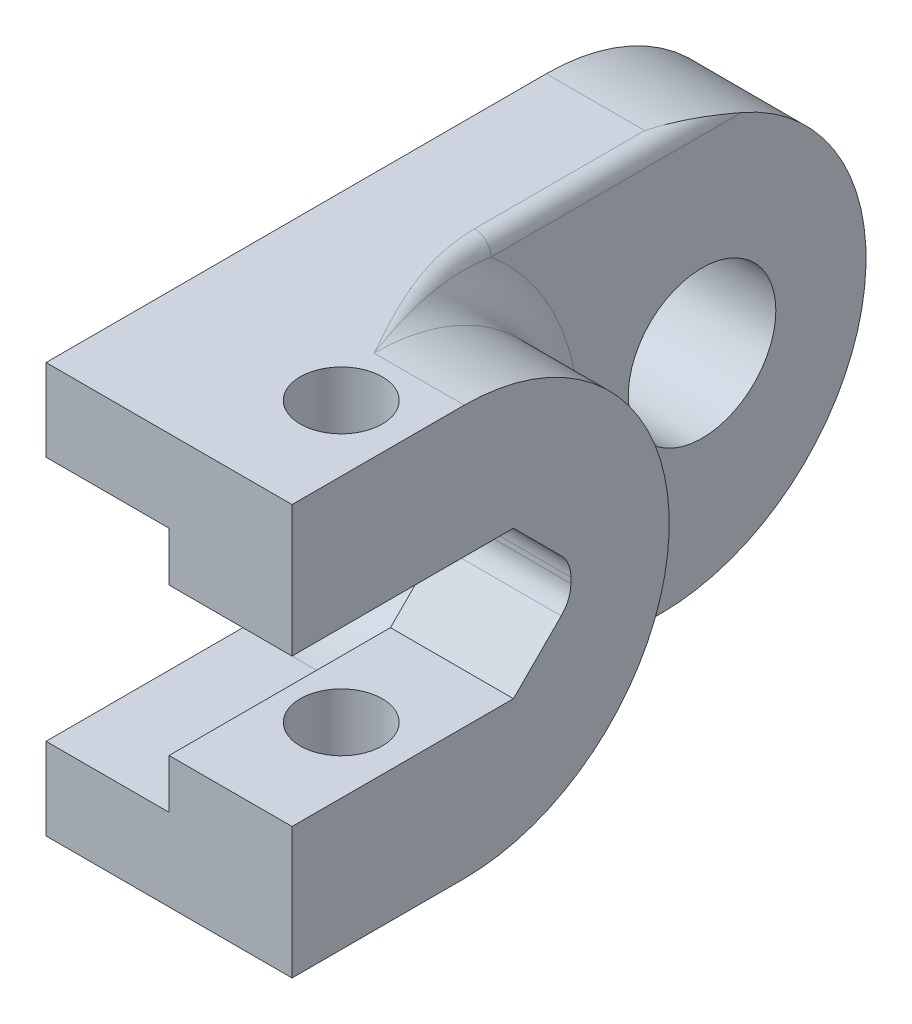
ISO-10303-21;
HEADER;
FILE_DESCRIPTION(('STEP AP214'),'2;1');
FILE_NAME('part.step','',(''),(''),'','','');
FILE_SCHEMA(('AUTOMOTIVE_DESIGN { 1 0 10303 214 1 1 1 1 }'));
ENDSEC;
DATA;
#1=APPLICATION_CONTEXT('core data for automotive mechanical design processes');
#2=APPLICATION_PROTOCOL_DEFINITION('international standard','automotive_design',2000,#1);
#3=PRODUCT_CONTEXT('',#1,'mechanical');
#4=PRODUCT('Part','Part','',(#3));
#5=PRODUCT_RELATED_PRODUCT_CATEGORY('part','',(#4));
#6=PRODUCT_DEFINITION_FORMATION('','',#4);
#7=PRODUCT_DEFINITION_CONTEXT('part definition',#1,'design');
#8=PRODUCT_DEFINITION('design','',#6,#7);
#9=PRODUCT_DEFINITION_SHAPE('','',#8);
#10=(LENGTH_UNIT() NAMED_UNIT(*) SI_UNIT(.MILLI.,.METRE.));
#11=(NAMED_UNIT(*) PLANE_ANGLE_UNIT() SI_UNIT($,.RADIAN.));
#12=(NAMED_UNIT(*) SI_UNIT($,.STERADIAN.) SOLID_ANGLE_UNIT());
#13=UNCERTAINTY_MEASURE_WITH_UNIT(LENGTH_MEASURE(1.E-05),#10,'distance_accuracy_value','');
#14=(GEOMETRIC_REPRESENTATION_CONTEXT(3) GLOBAL_UNCERTAINTY_ASSIGNED_CONTEXT((#13)) GLOBAL_UNIT_ASSIGNED_CONTEXT((#10,
#11,#12)) REPRESENTATION_CONTEXT('',''));
#15=CARTESIAN_POINT('',(0.,0.,0.));
#16=DIRECTION('',(0.,0.,1.));
#17=DIRECTION('',(1.,0.,0.));
#18=AXIS2_PLACEMENT_3D('',#15,#16,#17);
#19=CARTESIAN_POINT('',(-8.49999999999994,-0.171572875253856,16.));
#20=DIRECTION('',(0.,0.,-1.));
#21=DIRECTION('',(0.,1.,0.));
#22=AXIS2_PLACEMENT_3D('',#19,#20,#21);
#23=PLANE('',#22);
#24=DIRECTION('',(-1.,0.,0.));
#25=VECTOR('',#24,1.);
#26=CARTESIAN_POINT('',(-4.74999999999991,0.171572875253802,16.));
#27=LINE('',#26,#25);
#28=CARTESIAN_POINT('',(-0.999999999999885,0.1715728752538,16.));
#29=VERTEX_POINT('',#28);
#30=CARTESIAN_POINT('',(-8.49999999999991,0.171572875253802,16.));
#31=VERTEX_POINT('',#30);
#32=EDGE_CURVE('E216',#29,#31,#27,.T.);
#33=ORIENTED_EDGE('',*,*,#32,.T.);
#34=DIRECTION('',(0.,1.,0.));
#35=VECTOR('',#34,1.);
#36=CARTESIAN_POINT('',(-8.49999999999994,0.,16.));
#37=LINE('',#36,#35);
#38=CARTESIAN_POINT('',(-8.49999999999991,-0.171572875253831,16.));
#39=VERTEX_POINT('',#38);
#40=EDGE_CURVE('E201',#39,#31,#37,.T.);
#41=ORIENTED_EDGE('',*,*,#40,.F.);
#42=DIRECTION('',(1.,0.,0.));
#43=VECTOR('',#42,1.);
#44=CARTESIAN_POINT('',(-4.74999999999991,-0.171572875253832,16.));
#45=LINE('',#44,#43);
#46=CARTESIAN_POINT('',(-0.999999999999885,-0.171572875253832,16.));
#47=VERTEX_POINT('',#46);
#48=EDGE_CURVE('E227',#39,#47,#45,.T.);
#49=ORIENTED_EDGE('',*,*,#48,.T.);
#50=DIRECTION('',(0.,-1.,0.));
#51=VECTOR('',#50,1.);
#52=CARTESIAN_POINT('',(-0.999999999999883,0.,16.));
#53=LINE('',#52,#51);
#54=EDGE_CURVE('E213',#29,#47,#53,.T.);
#55=ORIENTED_EDGE('',*,*,#54,.F.);
#56=EDGE_LOOP('',(#33,#41,#49,#55));
#57=FACE_BOUND('',#56,.T.);
#58=ADVANCED_FACE('F15',(#57),#23,.F.);
#59=CARTESIAN_POINT('',(-8.49999999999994,0.1715728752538,18.));
#60=DIRECTION('',(1.,0.,0.));
#61=DIRECTION('',(0.,0.,-1.));
#62=AXIS2_PLACEMENT_3D('',#59,#60,#61);
#63=CYLINDRICAL_SURFACE('',#62,2.);
#64=DIRECTION('',(-1.,0.,0.));
#65=VECTOR('',#64,1.);
#66=CARTESIAN_POINT('',(-4.74999999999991,1.58578643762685,16.5857864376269));
#67=LINE('',#66,#65);
#68=CARTESIAN_POINT('',(-0.999999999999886,1.58578643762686,16.5857864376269));
#69=VERTEX_POINT('',#68);
#70=CARTESIAN_POINT('',(-8.4999999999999,1.58578643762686,16.5857864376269));
#71=VERTEX_POINT('',#70);
#72=EDGE_CURVE('E222',#69,#71,#67,.T.);
#73=ORIENTED_EDGE('',*,*,#72,.T.);
#74=CARTESIAN_POINT('',(-8.49999999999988,0.1715728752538,18.));
#75=DIRECTION('',(1.,0.,0.));
#76=DIRECTION('',(0.,0.,-1.));
#77=AXIS2_PLACEMENT_3D('',#74,#75,#76);
#78=CIRCLE('',#77,2.);
#79=EDGE_CURVE('E19',#31,#71,#78,.T.);
#80=ORIENTED_EDGE('',*,*,#79,.F.);
#81=ORIENTED_EDGE('',*,*,#32,.F.);
#82=CARTESIAN_POINT('',(-0.999999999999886,0.1715728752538,18.));
#83=DIRECTION('',(1.,0.,0.));
#84=DIRECTION('',(0.,0.,-1.));
#85=AXIS2_PLACEMENT_3D('',#82,#83,#84);
#86=CIRCLE('',#85,2.);
#87=EDGE_CURVE('E224',#69,#29,#86,.F.);
#88=ORIENTED_EDGE('',*,*,#87,.F.);
#89=EDGE_LOOP('',(#73,#80,#81,#88));
#90=FACE_BOUND('',#89,.T.);
#91=ADVANCED_FACE('F220',(#90),#63,.F.);
#92=CARTESIAN_POINT('',(-8.49999999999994,-0.171572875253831,18.));
#93=DIRECTION('',(1.,0.,0.));
#94=DIRECTION('',(0.,0.,-1.));
#95=AXIS2_PLACEMENT_3D('',#92,#93,#94);
#96=CYLINDRICAL_SURFACE('',#95,2.);
#97=ORIENTED_EDGE('',*,*,#48,.F.);
#98=CARTESIAN_POINT('',(-8.49999999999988,-0.171572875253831,18.));
#99=DIRECTION('',(1.,0.,0.));
#100=DIRECTION('',(0.,0.,-1.));
#101=AXIS2_PLACEMENT_3D('',#98,#99,#100);
#102=CIRCLE('',#101,2.);
#103=CARTESIAN_POINT('',(-8.4999999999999,-1.58578643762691,16.5857864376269));
#104=VERTEX_POINT('',#103);
#105=EDGE_CURVE('E209',#104,#39,#102,.T.);
#106=ORIENTED_EDGE('',*,*,#105,.F.);
#107=DIRECTION('',(1.,0.,0.));
#108=VECTOR('',#107,1.);
#109=CARTESIAN_POINT('',(-4.74999999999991,-1.5857864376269,16.5857864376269));
#110=LINE('',#109,#108);
#111=CARTESIAN_POINT('',(-0.999999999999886,-1.58578643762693,16.5857864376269));
#112=VERTEX_POINT('',#111);
#113=EDGE_CURVE('E619',#104,#112,#110,.T.);
#114=ORIENTED_EDGE('',*,*,#113,.T.);
#115=CARTESIAN_POINT('',(-0.999999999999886,-0.171572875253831,18.));
#116=DIRECTION('',(1.,0.,0.));
#117=DIRECTION('',(0.,0.,-1.));
#118=AXIS2_PLACEMENT_3D('',#115,#116,#117);
#119=CIRCLE('',#118,2.);
#120=EDGE_CURVE('E230',#47,#112,#119,.F.);
#121=ORIENTED_EDGE('',*,*,#120,.F.);
#122=EDGE_LOOP('',(#97,#106,#114,#121));
#123=FACE_BOUND('',#122,.T.);
#124=ADVANCED_FACE('F821',(#123),#96,.F.);
#125=CARTESIAN_POINT('',(-8.49999999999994,1.58578643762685,16.5857864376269));
#126=DIRECTION('',(0.,0.707106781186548,-0.707106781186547));
#127=DIRECTION('',(0.,0.707106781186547,0.707106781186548));
#128=AXIS2_PLACEMENT_3D('',#125,#126,#127);
#129=PLANE('',#128);
#130=DIRECTION('',(-1.,0.,0.));
#131=VECTOR('',#130,1.);
#132=CARTESIAN_POINT('',(-4.74999999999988,4.49999999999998,19.5));
#133=LINE('',#132,#131);
#134=CARTESIAN_POINT('',(-0.999999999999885,4.49999999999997,19.5));
#135=VERTEX_POINT('',#134);
#136=CARTESIAN_POINT('',(-8.49999999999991,4.49999999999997,19.5));
#137=VERTEX_POINT('',#136);
#138=EDGE_CURVE('E236',#135,#137,#133,.T.);
#139=ORIENTED_EDGE('',*,*,#138,.T.);
#140=DIRECTION('',(0.,0.707106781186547,0.707106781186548));
#141=VECTOR('',#140,1.);
#142=CARTESIAN_POINT('',(-8.49999999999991,1.58578643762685,16.5857864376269));
#143=LINE('',#142,#141);
#144=EDGE_CURVE('E250',#137,#71,#143,.F.);
#145=ORIENTED_EDGE('',*,*,#144,.T.);
#146=ORIENTED_EDGE('',*,*,#72,.F.);
#147=DIRECTION('',(0.,-0.707106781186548,-0.707106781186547));
#148=VECTOR('',#147,1.);
#149=CARTESIAN_POINT('',(-0.999999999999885,4.49999999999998,19.5));
#150=LINE('',#149,#148);
#151=EDGE_CURVE('E241',#135,#69,#150,.T.);
#152=ORIENTED_EDGE('',*,*,#151,.F.);
#153=EDGE_LOOP('',(#139,#145,#146,#152));
#154=FACE_BOUND('',#153,.T.);
#155=ADVANCED_FACE('F626',(#154),#129,.F.);
#156=CARTESIAN_POINT('',(-8.49999999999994,-4.50000000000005,19.5000000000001));
#157=DIRECTION('',(0.,-0.707106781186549,-0.707106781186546));
#158=DIRECTION('',(0.,0.707106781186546,-0.707106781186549));
#159=AXIS2_PLACEMENT_3D('',#156,#157,#158);
#160=PLANE('',#159);
#161=DIRECTION('',(1.,0.,0.));
#162=VECTOR('',#161,1.);
#163=CARTESIAN_POINT('',(-4.74999999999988,-4.50000000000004,19.5));
#164=LINE('',#163,#162);
#165=CARTESIAN_POINT('',(-8.4999999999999,-4.50000000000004,19.5));
#166=VERTEX_POINT('',#165);
#167=CARTESIAN_POINT('',(-0.999999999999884,-4.50000000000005,19.5));
#168=VERTEX_POINT('',#167);
#169=EDGE_CURVE('E246',#166,#168,#164,.T.);
#170=ORIENTED_EDGE('',*,*,#169,.T.);
#171=DIRECTION('',(0.,-0.707106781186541,0.707106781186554));
#172=VECTOR('',#171,1.);
#173=CARTESIAN_POINT('',(-0.999999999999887,-1.58578643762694,16.5857864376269));
#174=LINE('',#173,#172);
#175=EDGE_CURVE('E243',#112,#168,#174,.T.);
#176=ORIENTED_EDGE('',*,*,#175,.F.);
#177=ORIENTED_EDGE('',*,*,#113,.F.);
#178=DIRECTION('',(0.,0.707106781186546,-0.707106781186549));
#179=VECTOR('',#178,1.);
#180=CARTESIAN_POINT('',(-8.49999999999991,-4.50000000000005,19.5000000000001));
#181=LINE('',#180,#179);
#182=EDGE_CURVE('E253',#104,#166,#181,.F.);
#183=ORIENTED_EDGE('',*,*,#182,.T.);
#184=EDGE_LOOP('',(#170,#176,#177,#183));
#185=FACE_BOUND('',#184,.T.);
#186=ADVANCED_FACE('F809',(#185),#160,.F.);
#187=CARTESIAN_POINT('',(-8.49999999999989,4.49999999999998,19.5));
#188=DIRECTION('',(0.,1.,0.));
#189=DIRECTION('',(0.,0.,1.));
#190=AXIS2_PLACEMENT_3D('',#187,#188,#189);
#191=PLANE('',#190);
#192=CARTESIAN_POINT('',(-4.9999999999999,4.49999999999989,26.));
#193=DIRECTION('',(0.,1.,0.));
#194=DIRECTION('',(-1.,0.,0.));
#195=AXIS2_PLACEMENT_3D('',#192,#193,#194);
#196=CIRCLE('',#195,2.5);
#197=CARTESIAN_POINT('',(-7.4999999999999,4.49999999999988,26.));
#198=VERTEX_POINT('',#197);
#199=EDGE_CURVE('E232',#198,#198,#196,.T.);
#200=ORIENTED_EDGE('',*,*,#199,.T.);
#201=EDGE_LOOP('',(#200));
#202=FACE_BOUND('',#201,.T.);
#203=DIRECTION('',(1.,0.,0.));
#204=VECTOR('',#203,1.);
#205=CARTESIAN_POINT('',(-8.49999999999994,4.49999999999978,33.));
#206=LINE('',#205,#204);
#207=CARTESIAN_POINT('',(-8.49999999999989,4.49999999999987,33.));
#208=VERTEX_POINT('',#207);
#209=CARTESIAN_POINT('',(-0.999999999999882,4.49999999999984,33.));
#210=VERTEX_POINT('',#209);
#211=EDGE_CURVE('E441',#208,#210,#206,.T.);
#212=ORIENTED_EDGE('',*,*,#211,.F.);
#213=DIRECTION('',(0.,0.,-1.));
#214=VECTOR('',#213,1.);
#215=CARTESIAN_POINT('',(-8.49999999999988,4.49999999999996,23.1525));
#216=LINE('',#215,#214);
#217=EDGE_CURVE('E465',#208,#137,#216,.T.);
#218=ORIENTED_EDGE('',*,*,#217,.T.);
#219=ORIENTED_EDGE('',*,*,#138,.F.);
#220=DIRECTION('',(0.,0.,-1.));
#221=VECTOR('',#220,1.);
#222=CARTESIAN_POINT('',(-0.999999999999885,4.49999999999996,21.385));
#223=LINE('',#222,#221);
#224=EDGE_CURVE('E239',#210,#135,#223,.T.);
#225=ORIENTED_EDGE('',*,*,#224,.F.);
#226=EDGE_LOOP('',(#212,#218,#219,#225));
#227=FACE_BOUND('',#226,.T.);
#228=ADVANCED_FACE('F511',(#202,#227),#191,.F.);
#229=CARTESIAN_POINT('',(-6.50433397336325,12.5,22.4921440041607));
#230=CARTESIAN_POINT('',(-6.86049870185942,12.5,21.8465401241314));
#231=CARTESIAN_POINT('',(-7.575856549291,12.5,20.5497221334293));
#232=CARTESIAN_POINT('',(-8.46050224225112,12.5,18.7856841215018));
#233=CARTESIAN_POINT('',(-9.07803180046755,12.5,17.3118331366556));
#234=CARTESIAN_POINT('',(-9.39664433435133,12.5,16.3828046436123));
#235=CARTESIAN_POINT('',(-9.67209092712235,12.4999999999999,15.4356101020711));
#236=CARTESIAN_POINT('',(-9.86114416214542,12.5,14.5875671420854));
#237=CARTESIAN_POINT('',(-9.96399286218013,12.5,13.7296122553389));
#238=CARTESIAN_POINT('',(-9.99466936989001,12.5,13.238069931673));
#239=CARTESIAN_POINT('',(-9.99999999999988,12.5,12.9922084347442));
#240=CARTESIAN_POINT('',(-9.99999999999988,12.5,12.8693198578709));
#241=CARTESIAN_POINT('',(-6.50421604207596,12.5,22.4920789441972));
#242=CARTESIAN_POINT('',(-6.85068920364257,12.5,21.8411284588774));
#243=CARTESIAN_POINT('',(-7.54657965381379,12.499999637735,20.5335736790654));
#244=CARTESIAN_POINT('',(-8.40396418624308,12.4999932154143,18.7584871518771));
#245=CARTESIAN_POINT('',(-8.99794248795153,12.4999864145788,17.2805002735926));
#246=CARTESIAN_POINT('',(-9.30147004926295,12.4999937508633,16.3519676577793));
#247=CARTESIAN_POINT('',(-9.56154487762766,12.4999830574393,15.4075510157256));
#248=CARTESIAN_POINT('',(-9.73688225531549,12.4999875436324,14.5646753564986));
#249=CARTESIAN_POINT('',(-9.82658101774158,12.4999908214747,13.7163850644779));
#250=CARTESIAN_POINT('',(-9.85011924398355,12.4999944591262,13.231860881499));
#251=CARTESIAN_POINT('',(-9.85204913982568,12.4999867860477,12.9900424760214));
#252=CARTESIAN_POINT('',(-9.85040034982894,12.5,12.8693198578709));
#253=CARTESIAN_POINT('',(-6.50403914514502,12.4999999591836,22.4919813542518));
#254=CARTESIAN_POINT('',(-6.83597495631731,12.4999932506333,21.8330109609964));
#255=CARTESIAN_POINT('',(-7.50266444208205,12.4983145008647,20.5093509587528));
#256=CARTESIAN_POINT('',(-8.31915616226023,12.4916960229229,18.7176916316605));
#257=CARTESIAN_POINT('',(-8.87781330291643,12.4835433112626,17.2335039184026));
#258=CARTESIAN_POINT('',(-9.15872755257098,12.4773917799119,16.305719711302));
#259=CARTESIAN_POINT('',(-9.39576110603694,12.4705784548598,15.3654743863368));
#260=CARTESIAN_POINT('',(-9.55055385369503,12.4639006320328,14.5303541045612));
#261=CARTESIAN_POINT('',(-9.62057539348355,12.4564937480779,13.6965590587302));
#262=CARTESIAN_POINT('',(-9.63344115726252,12.4520686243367,13.2225559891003));
#263=CARTESIAN_POINT('',(-9.630285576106,12.4497944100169,12.9867976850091));
#264=CARTESIAN_POINT('',(-9.6261795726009,12.4486429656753,12.8693198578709));
#265=CARTESIAN_POINT('',(-6.50380328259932,12.4999998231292,22.4918512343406));
#266=CARTESIAN_POINT('',(-6.81635596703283,12.499970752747,21.8221876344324));
#267=CARTESIAN_POINT('',(-7.4441114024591,12.4926791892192,20.4770569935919));
#268=CARTESIAN_POINT('',(-8.20844079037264,12.4642163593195,18.664517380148));
#269=CARTESIAN_POINT('',(-8.72515666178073,12.4297653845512,17.1738774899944));
#270=CARTESIAN_POINT('',(-8.98094505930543,12.4041615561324,16.2481763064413));
#271=CARTESIAN_POINT('',(-9.1935401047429,12.3760883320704,15.3142351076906));
#272=CARTESIAN_POINT('',(-9.32789815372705,12.3489038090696,14.4895888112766));
#273=CARTESIAN_POINT('',(-9.38036320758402,12.3193011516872,13.6735192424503));
#274=CARTESIAN_POINT('',(-9.38437590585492,12.3017835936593,13.2118953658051));
#275=CARTESIAN_POINT('',(-9.37725326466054,12.2928372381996,12.9831085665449));
#276=CARTESIAN_POINT('',(-9.37129839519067,12.288325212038,12.8693198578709));
#277=CARTESIAN_POINT('',(-6.50359690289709,12.4999996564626,22.4917373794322));
#278=CARTESIAN_POINT('',(-6.79918935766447,12.4999431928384,21.8127172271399));
#279=CARTESIAN_POINT('',(-7.39287832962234,12.4857592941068,20.4488029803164));
#280=CARTESIAN_POINT('',(-8.11362396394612,12.4307507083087,18.6190524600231));
#281=CARTESIAN_POINT('',(-8.59806275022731,12.3649298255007,17.1243207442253));
#282=CARTESIAN_POINT('',(-8.83612169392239,12.3164969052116,16.20135236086));
#283=CARTESIAN_POINT('',(-9.03260433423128,12.2637609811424,15.2735357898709));
#284=CARTESIAN_POINT('',(-9.15486750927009,12.2131059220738,14.4581350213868));
#285=CARTESIAN_POINT('',(-9.19906690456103,12.1586398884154,13.6562034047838));
#286=CARTESIAN_POINT('',(-9.19969025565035,12.1266213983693,13.2040237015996));
#287=CARTESIAN_POINT('',(-9.19136080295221,12.110347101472,12.9804111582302));
#288=CARTESIAN_POINT('',(-9.18493622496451,12.1021514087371,12.8693198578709));
#289=CARTESIAN_POINT('',(-6.5033610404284,12.4999993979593,22.4916072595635));
#290=CARTESIAN_POINT('',(-6.77957038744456,12.4999004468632,21.8018939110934));
#291=CARTESIAN_POINT('',(-7.33432843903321,12.4749871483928,20.4165198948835));
#292=CARTESIAN_POINT('',(-8.00916916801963,12.3792951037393,18.5691071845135));
#293=CARTESIAN_POINT('',(-8.46497207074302,12.2667624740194,17.0725913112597));
#294=CARTESIAN_POINT('',(-8.69060242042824,12.1852241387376,16.1544038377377));
#295=CARTESIAN_POINT('',(-8.87827872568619,12.0973733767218,15.2346669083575));
#296=CARTESIAN_POINT('',(-8.99715853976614,12.0140732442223,14.4299172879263));
#297=CARTESIAN_POINT('',(-9.04447775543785,11.9262945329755,13.6415869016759));
#298=CARTESIAN_POINT('',(-9.04886358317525,11.8752429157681,13.1976639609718));
#299=CARTESIAN_POINT('',(-9.04309448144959,11.8494855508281,12.9782865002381));
#300=CARTESIAN_POINT('',(-9.0381235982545,11.8365644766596,12.8693198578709));
#301=CARTESIAN_POINT('',(-6.50318414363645,12.4999991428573,22.4915096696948));
#302=CARTESIAN_POINT('',(-6.76485617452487,12.4998582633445,21.7937764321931));
#303=CARTESIAN_POINT('',(-7.29042049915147,12.4642868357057,20.39231980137));
#304=CARTESIAN_POINT('',(-7.93562403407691,12.3293081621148,18.5341158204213));
#305=CARTESIAN_POINT('',(-8.37968692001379,12.1740056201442,17.0396509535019));
#306=CARTESIAN_POINT('',(-8.6049274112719,12.0636607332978,16.1268879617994));
#307=CARTESIAN_POINT('',(-8.79669932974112,11.9463675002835,15.2143295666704));
#308=CARTESIAN_POINT('',(-8.92436678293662,11.8370088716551,14.4174871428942));
#309=CARTESIAN_POINT('',(-8.98701460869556,11.7247654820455,13.636355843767));
#310=CARTESIAN_POINT('',(-9.00190148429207,11.6604018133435,13.195780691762));
#311=CARTESIAN_POINT('',(-9.00194037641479,11.628249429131,12.977734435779));
#312=CARTESIAN_POINT('',(-8.99999999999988,11.6121997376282,12.8693198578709));
#313=CARTESIAN_POINT('',(-6.50309569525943,12.4999990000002,22.4914608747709));
#314=CARTESIAN_POINT('',(-6.75749907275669,12.4998346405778,21.7897176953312));
#315=CARTESIAN_POINT('',(-7.26846896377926,12.4582667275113,20.380225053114));
#316=CARTESIAN_POINT('',(-7.90035874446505,12.3016266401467,18.5173938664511));
#317=CARTESIAN_POINT('',(-8.34145128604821,12.1236410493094,17.0249542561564));
#318=CARTESIAN_POINT('',(-8.56903166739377,11.9986016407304,16.1154040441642));
#319=CARTESIAN_POINT('',(-8.76577923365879,11.8667221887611,15.2067053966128));
#320=CARTESIAN_POINT('',(-8.90081725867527,11.7449839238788,14.413720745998));
#321=CARTESIAN_POINT('',(-8.97428061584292,11.6219647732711,13.635302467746));
#322=CARTESIAN_POINT('',(-8.99619240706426,11.5520169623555,13.1956121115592));
#323=CARTESIAN_POINT('',(-8.99999999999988,11.5172828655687,12.9777348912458));
#324=CARTESIAN_POINT('',(-8.99999999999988,11.5,12.8693198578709));
#325=B_SPLINE_SURFACE_WITH_KNOTS('',3,3,((#229,#230,#231,#232,#233,#234,#235,#236,#237,#238,
#239,#240),(#241,#242,#243,#244,#245,#246,#247,#248,#249,#250,#251,#252),(#253,#254,#255,#256,
#257,#258,#259,#260,#261,#262,#263,#264),(#265,#266,#267,#268,#269,#270,#271,#272,#273,#274,
#275,#276),(#277,#278,#279,#280,#281,#282,#283,#284,#285,#286,#287,#288),(#289,#290,#291,#292,
#293,#294,#295,#296,#297,#298,#299,#300),(#301,#302,#303,#304,#305,#306,#307,#308,#309,#310,
#311,#312),(#313,#314,#315,#316,#317,#318,#319,#320,#321,#322,#323,#324)),.UNSPECIFIED.,.F.,.F.,
.F.,(4,1,1,1,1,4),(4,1,1,1,1,1,1,1,1,4),(0.,0.285714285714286,0.428571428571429,
0.571428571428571,0.785714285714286,1.),(0.,2.21199438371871,4.42398876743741,5.89865168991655,
7.0046488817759,7.37331461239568,8.84797753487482,9.58530899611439,9.95397472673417,
10.322640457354),.UNSPECIFIED.);
#326=CARTESIAN_POINT('',(-8.99999999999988,11.5,12.8693198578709));
#327=CARTESIAN_POINT('',(-8.99999999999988,11.6121997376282,12.8693198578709));
#328=CARTESIAN_POINT('',(-9.0381235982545,11.8365644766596,12.8693198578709));
#329=CARTESIAN_POINT('',(-9.18493622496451,12.1021514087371,12.8693198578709));
#330=CARTESIAN_POINT('',(-9.37129839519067,12.288325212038,12.8693198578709));
#331=CARTESIAN_POINT('',(-9.6261795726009,12.4486429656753,12.8693198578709));
#332=CARTESIAN_POINT('',(-9.85040034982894,12.5,12.8693198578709));
#333=CARTESIAN_POINT('',(-9.99999999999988,12.5,12.8693198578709));
#334=B_SPLINE_CURVE_WITH_KNOTS('',3,(#326,#327,#328,#329,#330,#331,#332,#333),.UNSPECIFIED.,.F.,
.F.,(4,1,1,1,1,4),(0.,0.214285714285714,0.428571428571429,0.571428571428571,0.714285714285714,
1.),.UNSPECIFIED.);
#335=CARTESIAN_POINT('',(-9.99999999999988,12.5,12.8693198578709));
#336=VERTEX_POINT('',#335);
#337=CARTESIAN_POINT('',(-8.99999999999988,11.5,12.8693198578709));
#338=VERTEX_POINT('',#337);
#339=EDGE_CURVE('E235',#336,#338,#334,.F.);
#340=CARTESIAN_POINT('',(-9.99999999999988,12.5,12.8693198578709));
#341=CARTESIAN_POINT('',(-10.0000001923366,12.5,12.9649358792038));
#342=CARTESIAN_POINT('',(-9.99838635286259,12.5,13.0605459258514));
#343=CARTESIAN_POINT('',(-9.99209037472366,12.5,13.2517551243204));
#344=CARTESIAN_POINT('',(-9.98740537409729,12.5,13.3473541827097));
#345=CARTESIAN_POINT('',(-9.97512084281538,12.5,13.5384663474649));
#346=CARTESIAN_POINT('',(-9.96751818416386,12.5,13.6339792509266));
#347=CARTESIAN_POINT('',(-9.94954283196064,12.5,13.8248467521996));
#348=CARTESIAN_POINT('',(-9.93916709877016,12.5,13.9202010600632));
#349=CARTESIAN_POINT('',(-9.90407040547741,12.5,14.2060815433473));
#350=CARTESIAN_POINT('',(-9.87539957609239,12.5,14.3961331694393));
#351=CARTESIAN_POINT('',(-9.80861450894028,12.5,14.774805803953));
#352=CARTESIAN_POINT('',(-9.77048752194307,12.5,14.9634245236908));
#353=CARTESIAN_POINT('',(-9.68583829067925,12.5,15.3386611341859));
#354=CARTESIAN_POINT('',(-9.6393201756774,12.5,15.5252799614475));
#355=CARTESIAN_POINT('',(-9.53893033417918,12.5,15.8959677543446));
#356=CARTESIAN_POINT('',(-9.48507909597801,12.5,16.0800423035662));
#357=CARTESIAN_POINT('',(-9.37095504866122,12.5,16.445570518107));
#358=CARTESIAN_POINT('',(-9.31070212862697,12.5,16.6270304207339));
#359=CARTESIAN_POINT('',(-9.18442906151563,12.5,16.9877171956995));
#360=CARTESIAN_POINT('',(-9.11841483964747,12.5,17.1669461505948));
#361=CARTESIAN_POINT('',(-8.98127066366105,12.5,17.5235241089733));
#362=CARTESIAN_POINT('',(-8.9101383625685,12.5,17.7008722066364));
#363=CARTESIAN_POINT('',(-8.7633384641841,12.5,18.0538534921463));
#364=CARTESIAN_POINT('',(-8.68766704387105,12.5,18.2294850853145));
#365=CARTESIAN_POINT('',(-8.53239526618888,12.5,18.5791941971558));
#366=CARTESIAN_POINT('',(-8.452791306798,12.5,18.7532701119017));
#367=CARTESIAN_POINT('',(-8.29019751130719,12.5,19.1000263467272));
#368=CARTESIAN_POINT('',(-8.20720460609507,12.5,19.2727052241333));
#369=CARTESIAN_POINT('',(-8.03835430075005,12.5,19.6168295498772));
#370=CARTESIAN_POINT('',(-7.95249460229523,12.5,19.7882738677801));
#371=CARTESIAN_POINT('',(-7.77843499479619,12.5,20.1300927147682));
#372=CARTESIAN_POINT('',(-7.69023375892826,12.5,20.3004665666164));
#373=CARTESIAN_POINT('',(-7.51201768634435,12.5,20.6403071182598));
#374=CARTESIAN_POINT('',(-7.42200246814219,12.5,20.8097736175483));
#375=CARTESIAN_POINT('',(-7.24066301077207,12.5,21.1479363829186));
#376=CARTESIAN_POINT('',(-7.14933918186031,12.5,21.3166328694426));
#377=CARTESIAN_POINT('',(-6.96588535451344,12.5,21.6533856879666));
#378=CARTESIAN_POINT('',(-6.87375616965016,12.5,21.8214424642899));
#379=CARTESIAN_POINT('',(-6.68919624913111,12.5,22.1570481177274));
#380=CARTESIAN_POINT('',(-6.5967662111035,12.5,22.3245973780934));
#381=CARTESIAN_POINT('',(-6.50433397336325,12.5,22.4921440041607));
#382=B_SPLINE_CURVE_WITH_KNOTS('',3,(#340,#341,#342,#343,#344,#345,#346,#347,#348,#349,#350,
#351,#352,#353,#354,#355,#356,#357,#358,#359,#360,#361,#362,#363,#364,#365,#366,#367,#368,#369,
#370,#371,#372,#373,#374,#375,#376,#377,#378,#379,#380,#381),.UNSPECIFIED.,.F.,.F.,(4,2,2,2,2,2,
2,2,2,2,2,2,2,2,2,2,2,2,2,2,4),(0.,0.286825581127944,0.57391883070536,0.861320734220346,
1.14903896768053,1.72535248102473,2.30244727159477,2.87925884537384,3.45449070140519,
4.02798494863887,4.60089618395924,5.17407183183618,5.74773719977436,6.32193812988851,
6.89667113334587,7.4718765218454,8.0474151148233,8.62307603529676,9.19856026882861,
9.77351824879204,10.3475763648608),.UNSPECIFIED.);
#383=CARTESIAN_POINT('',(-6.50371483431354,12.4999995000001,22.4918024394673));
#384=VERTEX_POINT('',#383);
#385=EDGE_CURVE('E434',#384,#336,#382,.F.);
#386=CARTESIAN_POINT('',(-6.50309569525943,12.4999990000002,22.4914608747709));
#387=CARTESIAN_POINT('',(-6.75749907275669,12.4998346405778,21.7897176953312));
#388=CARTESIAN_POINT('',(-7.26846896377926,12.4582667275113,20.380225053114));
#389=CARTESIAN_POINT('',(-7.90035874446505,12.3016266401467,18.5173938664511));
#390=CARTESIAN_POINT('',(-8.34145128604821,12.1236410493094,17.0249542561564));
#391=CARTESIAN_POINT('',(-8.56903166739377,11.9986016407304,16.1154040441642));
#392=CARTESIAN_POINT('',(-8.76577923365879,11.8667221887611,15.2067053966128));
#393=CARTESIAN_POINT('',(-8.90081725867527,11.7449839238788,14.413720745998));
#394=CARTESIAN_POINT('',(-8.97428061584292,11.6219647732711,13.635302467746));
#395=CARTESIAN_POINT('',(-8.99619240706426,11.5520169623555,13.1956121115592));
#396=CARTESIAN_POINT('',(-8.99999999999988,11.5172828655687,12.9777348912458));
#397=CARTESIAN_POINT('',(-8.99999999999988,11.5,12.8693198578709));
#398=B_SPLINE_CURVE_WITH_KNOTS('',3,(#386,#387,#388,#389,#390,#391,#392,#393,#394,#395,#396,
#397),.UNSPECIFIED.,.F.,.F.,(4,1,1,1,1,1,1,1,1,4),(0.,2.21199438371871,4.42398876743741,
5.89865168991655,7.0046488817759,7.37331461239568,8.84797753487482,9.58530899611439,
9.95397472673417,10.322640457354),.UNSPECIFIED.);
#399=EDGE_CURVE('E240',#338,#384,#398,.F.);
#400=ORIENTED_EDGE('',*,*,#339,.F.);
#401=ORIENTED_EDGE('',*,*,#385,.F.);
#402=ORIENTED_EDGE('',*,*,#399,.F.);
#403=EDGE_LOOP('',(#400,#401,#402));
#404=FACE_BOUND('',#403,.T.);
#405=ADVANCED_FACE('F498',(#404),#325,.T.);
#406=CARTESIAN_POINT('',(-4.9999999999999,4.49999999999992,26.));
#407=DIRECTION('',(0.,1.,0.));
#408=DIRECTION('',(-1.,0.,0.));
#409=AXIS2_PLACEMENT_3D('',#406,#407,#408);
#410=CYLINDRICAL_SURFACE('',#409,2.5);
#411=ORIENTED_EDGE('',*,*,#199,.F.);
#412=EDGE_LOOP('',(#411));
#413=FACE_BOUND('',#412,.T.);
#414=CARTESIAN_POINT('',(-4.9999999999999,12.5,26.));
#415=DIRECTION('',(0.,1.,0.));
#416=DIRECTION('',(-1.,0.,0.));
#417=AXIS2_PLACEMENT_3D('',#414,#415,#416);
#418=CIRCLE('',#417,2.5);
#419=CARTESIAN_POINT('',(-7.4999999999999,12.5,26.));
#420=VERTEX_POINT('',#419);
#421=EDGE_CURVE('E433',#420,#420,#418,.F.);
#422=ORIENTED_EDGE('',*,*,#421,.F.);
#423=EDGE_LOOP('',(#422));
#424=FACE_BOUND('',#423,.T.);
#425=ADVANCED_FACE('F510',(#413,#424),#410,.F.);
#426=CARTESIAN_POINT('',(-9.99999999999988,11.5,12.8693198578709));
#427=DIRECTION('',(0.,0.,-1.));
#428=DIRECTION('',(0.,1.,0.));
#429=AXIS2_PLACEMENT_3D('',#426,#427,#428);
#430=CYLINDRICAL_SURFACE('',#429,0.999999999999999);
#431=DIRECTION('',(0.,0.,-1.));
#432=VECTOR('',#431,1.);
#433=CARTESIAN_POINT('',(-9.99999999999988,12.5,17.7499999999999));
#434=LINE('',#433,#432);
#435=CARTESIAN_POINT('',(-9.99999999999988,12.5,2.49999999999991));
#436=VERTEX_POINT('',#435);
#437=EDGE_CURVE('E431',#336,#436,#434,.T.);
#438=ORIENTED_EDGE('',*,*,#437,.F.);
#439=ORIENTED_EDGE('',*,*,#339,.T.);
#440=DIRECTION('',(0.,0.,-1.));
#441=VECTOR('',#440,1.);
#442=CARTESIAN_POINT('',(-8.99999999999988,11.5,1.98317682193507));
#443=LINE('',#442,#441);
#444=CARTESIAN_POINT('',(-8.99999999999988,11.5,-2.39897948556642));
#445=VERTEX_POINT('',#444);
#446=EDGE_CURVE('E261',#338,#445,#443,.T.);
#447=ORIENTED_EDGE('',*,*,#446,.T.);
#448=CARTESIAN_POINT('',(-9.99999999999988,12.4999999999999,2.49999999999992));
#449=CARTESIAN_POINT('',(-9.99999886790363,12.4999999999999,2.50000000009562));
#450=CARTESIAN_POINT('',(-9.99999773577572,12.4999999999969,2.49999961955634));
#451=CARTESIAN_POINT('',(-9.99999560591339,12.4999999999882,2.4999985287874));
#452=CARTESIAN_POINT('',(-9.99999462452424,12.4999999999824,2.49999779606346));
#453=CARTESIAN_POINT('',(-9.99999261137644,12.4999999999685,2.49999604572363));
#454=CARTESIAN_POINT('',(-9.99999160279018,12.4999999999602,2.49999500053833));
#455=CARTESIAN_POINT('',(-9.9999897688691,12.4999999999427,2.499992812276));
#456=CARTESIAN_POINT('',(-9.9999889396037,12.4999999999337,2.49999167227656));
#457=CARTESIAN_POINT('',(-9.99998593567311,12.4999999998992,2.49998734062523));
#458=CARTESIAN_POINT('',(-9.9999839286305,12.4999999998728,2.49998402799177));
#459=CARTESIAN_POINT('',(-9.99998055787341,12.49999999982,2.49997740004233));
#460=CARTESIAN_POINT('',(-9.99997915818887,12.4999999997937,2.49997410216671));
#461=CARTESIAN_POINT('',(-9.99997342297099,12.4999999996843,2.49996038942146));
#462=CARTESIAN_POINT('',(-9.99996923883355,12.4999999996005,2.49994990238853));
#463=CARTESIAN_POINT('',(-9.99996294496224,12.4999999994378,2.49992991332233));
#464=CARTESIAN_POINT('',(-9.99996062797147,12.4999999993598,2.49992047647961));
#465=CARTESIAN_POINT('',(-9.99994396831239,12.4999999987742,2.49985108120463));
#466=CARTESIAN_POINT('',(-9.99993156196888,12.4999999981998,2.49979076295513));
#467=CARTESIAN_POINT('',(-9.99987726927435,12.4999999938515,2.49955317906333));
#468=CARTESIAN_POINT('',(-9.99982524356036,12.4999999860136,2.49937829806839));
#469=CARTESIAN_POINT('',(-9.99962338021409,12.4999999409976,2.49868739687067));
#470=CARTESIAN_POINT('',(-9.99948028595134,12.4999998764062,2.49817000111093));
#471=CARTESIAN_POINT('',(-9.99890853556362,12.4999994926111,2.49611896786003));
#472=CARTESIAN_POINT('',(-9.99847150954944,12.4999989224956,2.49458707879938));
#473=CARTESIAN_POINT('',(-9.99665425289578,12.499995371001,2.48819935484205));
#474=CARTESIAN_POINT('',(-9.99528440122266,12.499989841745,2.48334135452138));
#475=CARTESIAN_POINT('',(-9.9687371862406,12.4998278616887,2.38921916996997));
#476=CARTESIAN_POINT('',(-9.94344814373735,12.4987183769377,2.29997682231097));
#477=CARTESIAN_POINT('',(-9.89406570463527,12.4946704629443,2.12510793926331));
#478=CARTESIAN_POINT('',(-9.86996536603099,12.491807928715,2.03948134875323));
#479=CARTESIAN_POINT('',(-9.81888345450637,12.4838423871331,1.8573364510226));
#480=CARTESIAN_POINT('',(-9.79192631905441,12.4785002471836,1.76082146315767));
#481=CARTESIAN_POINT('',(-9.73810303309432,12.4654976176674,1.56676361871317));
#482=CARTESIAN_POINT('',(-9.71124121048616,12.4578120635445,1.46922123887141));
#483=CARTESIAN_POINT('',(-9.66565681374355,12.4426637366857,1.30208213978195));
#484=CARTESIAN_POINT('',(-9.64680309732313,12.4357656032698,1.23246958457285));
#485=CARTESIAN_POINT('',(-9.60947271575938,12.4208103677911,1.09346403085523));
#486=CARTESIAN_POINT('',(-9.59099519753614,12.4127563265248,1.02407093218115));
#487=CARTESIAN_POINT('',(-9.53703774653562,12.3872556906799,0.819376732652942));
#488=CARTESIAN_POINT('',(-9.5020944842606,12.3681591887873,0.684137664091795));
#489=CARTESIAN_POINT('',(-9.41396625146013,12.3128056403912,0.333835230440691));
#490=CARTESIAN_POINT('',(-9.36223580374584,12.2730838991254,0.11893750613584));
#491=CARTESIAN_POINT('',(-9.26526644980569,12.181649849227,-0.311817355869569));
#492=CARTESIAN_POINT('',(-9.22008776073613,12.1298364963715,-0.527666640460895));
#493=CARTESIAN_POINT('',(-9.13623372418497,12.0096169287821,-0.975186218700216));
#494=CARTESIAN_POINT('',(-9.09836092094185,11.9402190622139,-1.20675007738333));
#495=CARTESIAN_POINT('',(-9.05365150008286,11.8257123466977,-1.55181113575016));
#496=CARTESIAN_POINT('',(-9.04077432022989,11.7858696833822,-1.66629654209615));
#497=CARTESIAN_POINT('',(-9.01982367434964,11.7027199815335,-1.89443681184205));
#498=CARTESIAN_POINT('',(-9.01174914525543,11.6594137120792,-2.00809185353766));
#499=CARTESIAN_POINT('',(-9.00153641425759,11.5707330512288,-2.23097164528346));
#500=CARTESIAN_POINT('',(-8.99922925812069,11.5254580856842,-2.34022781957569));
#501=CARTESIAN_POINT('',(-9.0012275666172,11.4317973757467,-2.55746997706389));
#502=CARTESIAN_POINT('',(-9.00553815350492,11.3834092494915,-2.66545491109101));
#503=CARTESIAN_POINT('',(-9.02221975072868,11.2845341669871,-2.87799537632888));
#504=CARTESIAN_POINT('',(-9.03447590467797,11.2340865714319,-2.98257780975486));
#505=CARTESIAN_POINT('',(-9.06897740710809,11.1310034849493,-3.18893716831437));
#506=CARTESIAN_POINT('',(-9.09120931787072,11.0783710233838,-3.2907176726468));
#507=CARTESIAN_POINT('',(-9.13448708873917,10.9981839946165,-3.44081176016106));
#508=CARTESIAN_POINT('',(-9.1507152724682,10.9710569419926,-3.49074924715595));
#509=CARTESIAN_POINT('',(-9.18704988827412,10.9167491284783,-3.58914915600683));
#510=CARTESIAN_POINT('',(-9.20715419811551,10.8895684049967,-3.63761236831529));
#511=CARTESIAN_POINT('',(-9.25181448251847,10.8355894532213,-3.73241253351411));
#512=CARTESIAN_POINT('',(-9.27635366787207,10.8087901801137,-3.77875670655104));
#513=CARTESIAN_POINT('',(-9.33071041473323,10.7560340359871,-3.86870772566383));
#514=CARTESIAN_POINT('',(-9.36051977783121,10.7300759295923,-3.91231868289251));
#515=CARTESIAN_POINT('',(-9.41773172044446,10.686431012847,-3.98471159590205));
#516=CARTESIAN_POINT('',(-9.44371117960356,10.6683620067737,-4.01438057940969));
#517=CARTESIAN_POINT('',(-9.49950488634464,10.633636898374,-4.07091050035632));
#518=CARTESIAN_POINT('',(-9.52932180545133,10.6169817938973,-4.0977694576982));
#519=CARTESIAN_POINT('',(-9.59343562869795,10.5856741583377,-4.14788570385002));
#520=CARTESIAN_POINT('',(-9.62777594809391,10.5710442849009,-4.17110257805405));
#521=CARTESIAN_POINT('',(-9.70069765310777,10.5450628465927,-4.21209657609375));
#522=CARTESIAN_POINT('',(-9.73926913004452,10.5337038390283,-4.22988605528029));
#523=CARTESIAN_POINT('',(-9.80905384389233,10.5179348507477,-4.25449483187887));
#524=CARTESIAN_POINT('',(-9.83944046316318,10.5124766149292,-4.26297937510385));
#525=CARTESIAN_POINT('',(-9.90147526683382,10.5043755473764,-4.27555544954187));
#526=CARTESIAN_POINT('',(-9.93312239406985,10.5017304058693,-4.27965058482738));
#527=CARTESIAN_POINT('',(-9.99687698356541,10.4994949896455,-4.28311210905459));
#528=CARTESIAN_POINT('',(-10.0289854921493,10.4999133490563,-4.28246513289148));
#529=CARTESIAN_POINT('',(-10.0925742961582,10.503784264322,-4.27646869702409));
#530=CARTESIAN_POINT('',(-10.1240543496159,10.5072379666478,-4.27111746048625));
#531=CARTESIAN_POINT('',(-10.1845729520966,10.5167180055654,-4.25638325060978));
#532=CARTESIAN_POINT('',(-10.2136568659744,10.5226616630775,-4.24712979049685));
#533=CARTESIAN_POINT('',(-10.2699405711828,10.5366854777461,-4.22520846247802));
#534=CARTESIAN_POINT('',(-10.2971396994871,10.5447663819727,-4.21253940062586));
#535=CARTESIAN_POINT('',(-10.3644767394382,10.5677706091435,-4.17629428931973));
#536=CARTESIAN_POINT('',(-10.4030617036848,10.5839565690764,-4.15063543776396));
#537=CARTESIAN_POINT('',(-10.4750172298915,10.6191078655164,-4.09436583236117));
#538=CARTESIAN_POINT('',(-10.5083716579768,10.6380814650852,-4.06374032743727));
#539=CARTESIAN_POINT('',(-10.5900149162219,10.6903613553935,-3.97842512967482));
#540=CARTESIAN_POINT('',(-10.6343056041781,10.7251068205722,-3.92082104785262));
#541=CARTESIAN_POINT('',(-10.7125646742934,10.7964005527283,-3.80021352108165));
#542=CARTESIAN_POINT('',(-10.7465219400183,10.8329507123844,-3.73720435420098));
#543=CARTESIAN_POINT('',(-10.8045623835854,10.904454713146,-3.61128631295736));
#544=CARTESIAN_POINT('',(-10.8290867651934,10.9393854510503,-3.54856347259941));
#545=CARTESIAN_POINT('',(-10.8721198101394,11.0089985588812,-3.42091602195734));
#546=CARTESIAN_POINT('',(-10.8906228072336,11.0436806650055,-3.35598940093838));
#547=CARTESIAN_POINT('',(-10.922735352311,11.1126770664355,-3.2239852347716));
#548=CARTESIAN_POINT('',(-10.9362991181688,11.1469851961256,-3.15689354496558));
#549=CARTESIAN_POINT('',(-10.9590938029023,11.214668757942,-3.02149777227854));
#550=CARTESIAN_POINT('',(-10.9683230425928,11.2480438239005,-2.9531932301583));
#551=CARTESIAN_POINT('',(-10.9834567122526,11.3154255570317,-2.81202231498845));
#552=CARTESIAN_POINT('',(-10.9891590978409,11.3493720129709,-2.7391059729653));
#553=CARTESIAN_POINT('',(-10.9970213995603,11.4159217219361,-2.59246705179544));
#554=CARTESIAN_POINT('',(-10.9991805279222,11.448524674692,-2.51874429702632));
#555=CARTESIAN_POINT('',(-11.001065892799,11.5443156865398,-2.29633675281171));
#556=CARTESIAN_POINT('',(-10.9961755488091,11.6053596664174,-2.14667704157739));
#557=CARTESIAN_POINT('',(-10.9773505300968,11.7189880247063,-1.85192544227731));
#558=CARTESIAN_POINT('',(-10.9637977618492,11.7718176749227,-1.70690020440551));
#559=CARTESIAN_POINT('',(-10.929883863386,11.8715873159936,-1.4164858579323));
#560=CARTESIAN_POINT('',(-10.90955826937,11.9185563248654,-1.27110250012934));
#561=CARTESIAN_POINT('',(-10.8663666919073,12.0012975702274,-0.99807651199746));
#562=CARTESIAN_POINT('',(-10.8441525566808,12.037734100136,-0.870529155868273));
#563=CARTESIAN_POINT('',(-10.796283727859,12.1063676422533,-0.615020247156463));
#564=CARTESIAN_POINT('',(-10.7706308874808,12.1385669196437,-0.487058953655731));
#565=CARTESIAN_POINT('',(-10.7158523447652,12.1994795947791,-0.227790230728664));
#566=CARTESIAN_POINT('',(-10.6866599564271,12.2280949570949,-0.0964739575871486));
#567=CARTESIAN_POINT('',(-10.6257682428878,12.2810545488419,0.166809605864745));
#568=CARTESIAN_POINT('',(-10.5940625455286,12.3053873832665,0.29877770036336));
#569=CARTESIAN_POINT('',(-10.5168278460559,12.3577808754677,0.610929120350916));
#570=CARTESIAN_POINT('',(-10.4704602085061,12.3839863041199,0.791218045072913));
#571=CARTESIAN_POINT('',(-10.3756993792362,12.4281986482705,1.15010872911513));
#572=CARTESIAN_POINT('',(-10.3273341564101,12.4462927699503,1.32870717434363));
#573=CARTESIAN_POINT('',(-10.2564544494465,12.4668211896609,1.58640681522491));
#574=CARTESIAN_POINT('',(-10.2345670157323,12.4723610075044,1.66544470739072));
#575=CARTESIAN_POINT('',(-10.1904612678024,12.4819549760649,1.82388858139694));
#576=CARTESIAN_POINT('',(-10.1682419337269,12.4860026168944,1.90329468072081));
#577=CARTESIAN_POINT('',(-10.1225741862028,12.4927412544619,2.06599221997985));
#578=CARTESIAN_POINT('',(-10.0991185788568,12.4953566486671,2.14928469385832));
#579=CARTESIAN_POINT('',(-10.0524349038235,12.4988930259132,2.31453910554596));
#580=CARTESIAN_POINT('',(-10.0292091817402,12.4998403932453,2.39650105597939));
#581=CARTESIAN_POINT('',(-10.0047146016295,12.499989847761,2.48334484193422));
#582=CARTESIAN_POINT('',(-10.0033437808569,12.4999953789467,2.48820633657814));
#583=CARTESIAN_POINT('',(-10.0015262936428,12.4999989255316,2.49459485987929));
#584=CARTESIAN_POINT('',(-10.0010900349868,12.4999994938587,2.49612406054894));
#585=CARTESIAN_POINT('',(-10.0005192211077,12.4999998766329,2.49817173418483));
#586=CARTESIAN_POINT('',(-10.0003763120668,12.4999999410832,2.498688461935));
#587=CARTESIAN_POINT('',(-10.0001746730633,12.4999999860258,2.49937858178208));
#588=CARTESIAN_POINT('',(-10.0001226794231,12.4999999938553,2.49955334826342));
#589=CARTESIAN_POINT('',(-10.0000684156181,12.4999999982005,2.4997907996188));
#590=CARTESIAN_POINT('',(-10.0000560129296,12.4999999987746,2.49985110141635));
#591=CARTESIAN_POINT('',(-10.0000393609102,12.49999999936,2.49992047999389));
#592=CARTESIAN_POINT('',(-10.0000370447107,12.499999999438,2.49992991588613));
#593=CARTESIAN_POINT('',(-10.0000307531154,12.4999999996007,2.49994990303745));
#594=CARTESIAN_POINT('',(-10.0000265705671,12.4999999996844,2.49996038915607));
#595=CARTESIAN_POINT('',(-10.0000208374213,12.4999999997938,2.49997410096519));
#596=CARTESIAN_POINT('',(-10.0000194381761,12.4999999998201,2.49997739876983));
#597=CARTESIAN_POINT('',(-10.0000160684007,12.4999999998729,2.49998402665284));
#598=CARTESIAN_POINT('',(-10.0000140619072,12.4999999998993,2.49998733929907));
#599=CARTESIAN_POINT('',(-10.0000110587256,12.4999999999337,2.49999167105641));
#600=CARTESIAN_POINT('',(-10.000010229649,12.4999999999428,2.49999281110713));
#601=CARTESIAN_POINT('',(-10.0000083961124,12.4999999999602,2.49999499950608));
#602=CARTESIAN_POINT('',(-10.0000073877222,12.4999999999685,2.49999604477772));
#603=CARTESIAN_POINT('',(-10.0000053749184,12.4999999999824,2.49999779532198));
#604=CARTESIAN_POINT('',(-10.0000043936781,12.4999999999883,2.49999852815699));
#605=CARTESIAN_POINT('',(-10.0000022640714,12.4999999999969,2.4999996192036));
#606=CARTESIAN_POINT('',(-10.0000011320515,12.5,2.49999999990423));
#607=CARTESIAN_POINT('',(-9.99999999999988,12.4999999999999,2.49999999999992));
#608=B_SPLINE_CURVE_WITH_KNOTS('',3,(#448,#449,#450,#451,#452,#453,#454,#455,#456,#457,#458,
#459,#460,#461,#462,#463,#464,#465,#466,#467,#468,#469,#470,#471,#472,#473,#474,#475,#476,#477,
#478,#479,#480,#481,#482,#483,#484,#485,#486,#487,#488,#489,#490,#491,#492,#493,#494,#495,#496,
#497,#498,#499,#500,#501,#502,#503,#504,#505,#506,#507,#508,#509,#510,#511,#512,#513,#514,#515,
#516,#517,#518,#519,#520,#521,#522,#523,#524,#525,#526,#527,#528,#529,#530,#531,#532,#533,#534,
#535,#536,#537,#538,#539,#540,#541,#542,#543,#544,#545,#546,#547,#548,#549,#550,#551,#552,#553,
#554,#555,#556,#557,#558,#559,#560,#561,#562,#563,#564,#565,#566,#567,#568,#569,#570,#571,#572,
#573,#574,#575,#576,#577,#578,#579,#580,#581,#582,#583,#584,#585,#586,#587,#588,#589,#590,#591,
#592,#593,#594,#595,#596,#597,#598,#599,#600,#601,#602,#603,#604,#605,#606,#607),.UNSPECIFIED.,
.T.,.F.,(4,2,2,2,2,2,2,2,2,2,2,2,2,2,2,2,2,2,2,2,2,2,2,2,2,2,2,2,2,2,2,2,2,2,2,2,2,2,2,2,2,2,2,
2,2,2,2,2,2,2,2,2,2,2,2,2,2,2,2,2,2,2,2,2,2,2,2,2,2,2,2,2,2,2,2,2,2,2,2,4),(0.,
3.41332189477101E-06,7.08149197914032E-06,1.14152584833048E-05,1.56413433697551E-05,
2.72151446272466E-05,3.79538359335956E-05,7.17578018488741E-05,0.000100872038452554,
0.000285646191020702,0.000832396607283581,0.00244348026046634,0.00722173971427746,
0.0223649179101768,0.300619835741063,0.567605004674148,0.868631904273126,1.17299870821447,
1.39033796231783,1.60711198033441,2.02997690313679,2.70331049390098,3.38248616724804,
4.1156557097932,4.48124739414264,4.84675812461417,5.20142874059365,5.55637401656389,
5.9062994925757,6.25575501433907,6.43294656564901,6.61004137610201,6.78647928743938,
6.96264510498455,7.09255609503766,7.2225580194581,7.35391359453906,7.48496787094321,
7.5806230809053,7.67619968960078,7.77204577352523,7.86792807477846,7.96085150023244,
8.05380744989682,8.20021325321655,8.34706212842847,8.58733193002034,8.82785930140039,
9.05512435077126,9.282602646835,9.5121387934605,9.74176378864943,9.98355381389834,
10.2253975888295,10.709963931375,11.1745159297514,11.6366678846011,12.0400433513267,
12.4432022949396,12.855700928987,13.2692810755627,13.8330535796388,14.390610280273,
14.6371976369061,14.8848483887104,15.1445504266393,15.4001063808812,15.4152604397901,
15.42003031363,15.4216393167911,15.4221857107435,15.4223704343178,15.4223995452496,
15.4224333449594,15.4224440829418,15.4224556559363,15.422459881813,15.4224642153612,
15.4224678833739,15.4224712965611),.UNSPECIFIED.);
#609=EDGE_CURVE('E308',#436,#445,#608,.T.);
#610=ORIENTED_EDGE('',*,*,#609,.F.);
#611=EDGE_LOOP('',(#438,#439,#447,#610));
#612=FACE_BOUND('',#611,.T.);
#613=ADVANCED_FACE('F548',(#612),#430,.T.);
#614=CARTESIAN_POINT('',(-6.4999999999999,0.,22.5));
#615=DIRECTION('',(1.,0.,0.));
#616=DIRECTION('',(0.,1.,0.));
#617=AXIS2_PLACEMENT_3D('',#614,#615,#616);
#618=CYLINDRICAL_SURFACE('',#617,12.5);
#619=CARTESIAN_POINT('',(-6.49999999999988,0.,22.5));
#620=DIRECTION('',(-1.,0.,0.));
#621=DIRECTION('',(0.,0.,1.));
#622=AXIS2_PLACEMENT_3D('',#619,#620,#621);
#623=CIRCLE('',#622,12.5);
#624=CARTESIAN_POINT('',(-6.49999999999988,12.5,22.5));
#625=VERTEX_POINT('',#624);
#626=CARTESIAN_POINT('',(-6.49999999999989,-12.5,22.5));
#627=VERTEX_POINT('',#626);
#628=EDGE_CURVE('E485',#625,#627,#623,.T.);
#629=ORIENTED_EDGE('',*,*,#628,.F.);
#630=DIRECTION('',(-1.,0.,0.));
#631=VECTOR('',#630,1.);
#632=CARTESIAN_POINT('',(-8.49999999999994,12.5,22.5));
#633=LINE('',#632,#631);
#634=CARTESIAN_POINT('',(-0.999999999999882,12.5,22.5));
#635=VERTEX_POINT('',#634);
#636=EDGE_CURVE('E496',#635,#625,#633,.T.);
#637=ORIENTED_EDGE('',*,*,#636,.F.);
#638=CARTESIAN_POINT('',(-0.999999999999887,0.,22.5));
#639=DIRECTION('',(1.,0.,0.));
#640=DIRECTION('',(0.,1.,0.));
#641=AXIS2_PLACEMENT_3D('',#638,#639,#640);
#642=CIRCLE('',#641,12.5);
#643=CARTESIAN_POINT('',(-0.99999999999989,-12.4999999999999,22.5));
#644=VERTEX_POINT('',#643);
#645=EDGE_CURVE('E237',#644,#635,#642,.T.);
#646=ORIENTED_EDGE('',*,*,#645,.F.);
#647=DIRECTION('',(1.,0.,0.));
#648=VECTOR('',#647,1.);
#649=CARTESIAN_POINT('',(-8.49999999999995,-12.4999999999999,22.5));
#650=LINE('',#649,#648);
#651=EDGE_CURVE('E421',#627,#644,#650,.T.);
#652=ORIENTED_EDGE('',*,*,#651,.F.);
#653=EDGE_LOOP('',(#629,#637,#646,#652));
#654=FACE_BOUND('',#653,.T.);
#655=ADVANCED_FACE('F289',(#654),#618,.T.);
#656=CARTESIAN_POINT('',(-6.49999999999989,0.,22.5));
#657=DIRECTION('',(-1.,0.,0.));
#658=DIRECTION('',(0.,0.,1.));
#659=AXIS2_PLACEMENT_3D('',#656,#657,#658);
#660=TOROIDAL_SURFACE('',#659,15.,2.5);
#661=ORIENTED_EDGE('',*,*,#399,.T.);
#662=CARTESIAN_POINT('',(-6.49999999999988,12.5,22.5));
#663=CARTESIAN_POINT('',(-6.50304292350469,12.5,22.4931958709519));
#664=CARTESIAN_POINT('',(-6.5060858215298,12.5,22.4863917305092));
#665=CARTESIAN_POINT('',(-6.51833062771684,12.5,22.4590111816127));
#666=CARTESIAN_POINT('',(-6.52753232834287,12.5,22.438434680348));
#667=CARTESIAN_POINT('',(-6.5367337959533,12.5,22.417858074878));
#668=B_SPLINE_CURVE_WITH_KNOTS('',3,(#662,#663,#664,#665,#666,#667),.UNSPECIFIED.,.F.,.F.,(4,2,
4),(0.,0.0223606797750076,0.0899814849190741),.UNSPECIFIED.);
#669=EDGE_CURVE('E569',#625,#384,#668,.T.);
#670=ORIENTED_EDGE('',*,*,#669,.F.);
#671=ORIENTED_EDGE('',*,*,#628,.T.);
#672=CARTESIAN_POINT('',(-8.99999999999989,-12.4999999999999,14.2084380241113));
#673=CARTESIAN_POINT('',(-8.99997976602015,-12.4999999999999,14.3626300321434));
#674=CARTESIAN_POINT('',(-8.99564245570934,-12.4999999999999,14.5167729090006));
#675=CARTESIAN_POINT('',(-8.97919896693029,-12.4999999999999,14.8245604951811));
#676=CARTESIAN_POINT('',(-8.96709732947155,-12.4999999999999,14.9782054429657));
#677=CARTESIAN_POINT('',(-8.93603266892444,-12.4999999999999,15.2843422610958));
#678=CARTESIAN_POINT('',(-8.91708925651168,-12.4999999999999,15.4368361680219));
#679=CARTESIAN_POINT('',(-8.87305855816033,-12.4999999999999,15.7409477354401));
#680=CARTESIAN_POINT('',(-8.84797027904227,-12.4999999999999,15.8925652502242));
#681=CARTESIAN_POINT('',(-8.76511141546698,-12.4999999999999,16.3425168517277));
#682=CARTESIAN_POINT('',(-8.69936581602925,-12.4999999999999,16.6393955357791));
#683=CARTESIAN_POINT('',(-8.55075134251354,-12.4999999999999,17.2289809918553));
#684=CARTESIAN_POINT('',(-8.46786819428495,-12.4999999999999,17.5216840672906));
#685=CARTESIAN_POINT('',(-8.25484169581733,-12.4999999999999,18.2123435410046));
#686=CARTESIAN_POINT('',(-8.11865558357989,-12.4999999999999,18.6084225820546));
#687=CARTESIAN_POINT('',(-7.828490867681,-12.5,19.3938395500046));
#688=CARTESIAN_POINT('',(-7.67451315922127,-12.5000000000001,19.783177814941));
#689=CARTESIAN_POINT('',(-7.1947405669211,-12.4999999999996,20.9463801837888));
#690=CARTESIAN_POINT('',(-6.85191383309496,-12.4999999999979,21.7130955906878));
#691=CARTESIAN_POINT('',(-6.50608578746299,-12.5,22.4863917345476));
#692=CARTESIAN_POINT('',(-6.50304288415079,-12.5,22.4931958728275));
#693=CARTESIAN_POINT('',(-6.49999999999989,-12.5,22.5));
#694=B_SPLINE_CURVE_WITH_KNOTS('',3,(#672,#673,#674,#675,#676,#677,#678,#679,#680,#681,#682,
#683,#684,#685,#686,#687,#688,#689,#690,#691,#692,#693),.UNSPECIFIED.,.F.,.F.,(4,2,2,2,2,2,2,2,
2,2,4),(0.,0.462444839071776,0.924619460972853,1.38547972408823,1.84641452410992,
2.7579111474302,3.67017005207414,4.92600462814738,6.18177604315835,8.70071919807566,
8.72307987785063),.UNSPECIFIED.);
#695=CARTESIAN_POINT('',(-8.99999999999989,-12.5,14.2084380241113));
#696=VERTEX_POINT('',#695);
#697=EDGE_CURVE('E297',#696,#627,#694,.T.);
#698=ORIENTED_EDGE('',*,*,#697,.F.);
#699=CARTESIAN_POINT('',(-8.99999999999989,-12.5000000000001,14.2084380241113));
#700=CARTESIAN_POINT('',(-8.99999999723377,-12.4095103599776,14.0719861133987));
#701=CARTESIAN_POINT('',(-8.99999999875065,-12.3167758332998,13.9370340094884));
#702=CARTESIAN_POINT('',(-9.00000000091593,-12.1269555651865,13.6702244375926));
#703=CARTESIAN_POINT('',(-9.00000000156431,-12.0298698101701,13.5383669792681));
#704=CARTESIAN_POINT('',(-8.99999999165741,-11.8116491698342,13.2517918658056));
#705=CARTESIAN_POINT('',(-8.99999997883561,-11.6895876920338,13.0977760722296));
#706=CARTESIAN_POINT('',(-8.99999998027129,-11.5412612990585,12.9182437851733));
#707=CARTESIAN_POINT('',(-8.99999998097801,-11.5179602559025,12.8902561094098));
#708=CARTESIAN_POINT('',(-8.99999998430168,-11.4084181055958,12.7596524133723));
#709=CARTESIAN_POINT('',(-8.99999998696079,-11.3208991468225,12.658104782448));
#710=CARTESIAN_POINT('',(-8.9999999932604,-11.0779612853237,12.3837529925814));
#711=CARTESIAN_POINT('',(-8.99999999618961,-10.9198348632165,12.213329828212));
#712=CARTESIAN_POINT('',(-8.99999999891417,-10.6738526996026,11.9602799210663));
#713=CARTESIAN_POINT('',(-8.99999999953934,-10.5888192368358,11.8748879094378));
#714=CARTESIAN_POINT('',(-9.00000000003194,-10.4309310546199,11.720102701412));
#715=CARTESIAN_POINT('',(-9.00000000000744,-10.3583838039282,11.650395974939));
#716=CARTESIAN_POINT('',(-8.99999999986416,-10.1630824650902,11.4664684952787));
#717=CARTESIAN_POINT('',(-8.99999999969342,-10.0390978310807,11.3535498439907));
#718=CARTESIAN_POINT('',(-8.99999999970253,-9.78742830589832,11.1319170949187));
#719=CARTESIAN_POINT('',(-8.99999999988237,-9.65974341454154,11.0232029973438));
#720=CARTESIAN_POINT('',(-9.00000000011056,-9.4008128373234,10.8101034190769));
#721=CARTESIAN_POINT('',(-9.00000000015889,-9.26956713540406,10.7057179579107));
#722=CARTESIAN_POINT('',(-8.99999999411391,-8.97707593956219,10.4809366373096));
#723=CARTESIAN_POINT('',(-8.99999998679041,-8.81508003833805,10.3615137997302));
#724=CARTESIAN_POINT('',(-8.99999997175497,-8.54081260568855,10.1677669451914));
#725=CARTESIAN_POINT('',(-8.99999996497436,-8.42983496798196,10.0916018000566));
#726=CARTESIAN_POINT('',(-8.99999996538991,-8.17783578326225,9.92367133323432));
#727=CARTESIAN_POINT('',(-8.99999997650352,-8.0362385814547,9.8327655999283));
#728=CARTESIAN_POINT('',(-8.99999999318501,-7.80722967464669,9.69130639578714));
#729=CARTESIAN_POINT('',(-8.99999999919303,-7.72079887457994,9.6391566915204));
#730=CARTESIAN_POINT('',(-9.00000000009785,-7.61647092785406,9.57753900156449));
#731=CARTESIAN_POINT('',(-9.00000000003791,-7.59903568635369,9.56728574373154));
#732=CARTESIAN_POINT('',(-8.99999999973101,-7.46668210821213,9.48979722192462));
#733=CARTESIAN_POINT('',(-9.00000000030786,-7.35092237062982,9.42399603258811));
#734=CARTESIAN_POINT('',(-8.99999999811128,-7.01435925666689,9.23856923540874));
#735=CARTESIAN_POINT('',(-8.99999999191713,-6.79134774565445,9.1229023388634));
#736=CARTESIAN_POINT('',(-8.99999998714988,-6.49793443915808,8.98000975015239));
#737=CARTESIAN_POINT('',(-8.99999998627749,-6.43002802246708,8.94757342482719));
#738=CARTESIAN_POINT('',(-8.9999999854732,-6.24666173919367,8.86169061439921));
#739=CARTESIAN_POINT('',(-8.99999998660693,-6.13074906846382,8.80920488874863));
#740=CARTESIAN_POINT('',(-8.99999998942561,-5.85001169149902,8.6863690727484));
#741=CARTESIAN_POINT('',(-8.99999999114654,-5.68454773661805,8.61747909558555));
#742=CARTESIAN_POINT('',(-8.99999999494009,-5.30291884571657,8.46656386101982));
#743=CARTESIAN_POINT('',(-8.99999999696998,-5.08596518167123,8.38652244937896));
#744=CARTESIAN_POINT('',(-8.99999999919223,-4.72024845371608,8.26112869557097));
#745=CARTESIAN_POINT('',(-8.99999999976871,-4.57243004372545,8.21300241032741));
#746=CARTESIAN_POINT('',(-9.00000000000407,-4.35669066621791,8.14644868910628));
#747=CARTESIAN_POINT('',(-8.99999999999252,-4.28933199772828,8.12618634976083));
#748=CARTESIAN_POINT('',(-8.99999999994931,-4.06434262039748,8.06022209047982));
#749=CARTESIAN_POINT('',(-8.99999999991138,-3.90608985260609,8.01662007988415));
#750=CARTESIAN_POINT('',(-8.99999999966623,-3.58824718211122,7.9346103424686));
#751=CARTESIAN_POINT('',(-8.99999999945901,-3.42865727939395,7.89620261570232));
#752=CARTESIAN_POINT('',(-9.00000000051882,-3.10830569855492,7.82464091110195));
#753=CARTESIAN_POINT('',(-9.00000000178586,-2.94754401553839,7.79148695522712));
#754=CARTESIAN_POINT('',(-8.99999999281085,-2.60198556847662,7.72602751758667));
#755=CARTESIAN_POINT('',(-8.99999998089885,-2.41703595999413,7.69451980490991));
#756=CARTESIAN_POINT('',(-8.99999998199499,-2.15592171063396,7.65523952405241));
#757=CARTESIAN_POINT('',(-8.99999998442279,-2.08019842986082,7.6444610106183));
#758=CARTESIAN_POINT('',(-8.99999999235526,-1.80233461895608,7.60707524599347));
#759=CARTESIAN_POINT('',(-8.9999999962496,-1.5997044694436,7.58400527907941));
#760=CARTESIAN_POINT('',(-8.99999999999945,-1.20056837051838,7.54677743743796));
#761=CARTESIAN_POINT('',(-8.99999999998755,-1.00408799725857,7.53234364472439));
#762=CARTESIAN_POINT('',(-8.99999999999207,-0.723108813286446,7.51719407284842));
#763=CARTESIAN_POINT('',(-8.99999999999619,-0.638769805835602,7.51335231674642));
#764=CARTESIAN_POINT('',(-8.99999999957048,-0.432747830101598,7.50570099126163));
#765=CARTESIAN_POINT('',(-8.99999999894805,-0.311036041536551,7.50265622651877));
#766=CARTESIAN_POINT('',(-8.99999999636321,0.0373499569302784,7.49819015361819));
#767=CARTESIAN_POINT('',(-8.9999999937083,0.264083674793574,7.50042940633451));
#768=CARTESIAN_POINT('',(-8.99999998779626,0.636892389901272,7.51256458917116));
#769=CARTESIAN_POINT('',(-8.99999998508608,0.783073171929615,7.5194655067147));
#770=CARTESIAN_POINT('',(-8.99999998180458,0.994972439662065,7.53258744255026));
#771=CARTESIAN_POINT('',(-8.99999998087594,1.06079916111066,7.53710121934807));
#772=CARTESIAN_POINT('',(-8.99999998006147,1.29261148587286,7.55455466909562));
#773=CARTESIAN_POINT('',(-8.99999998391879,1.4584261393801,7.56985576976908));
#774=CARTESIAN_POINT('',(-8.99999998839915,1.78945170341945,7.6059450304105));
#775=CARTESIAN_POINT('',(-8.99999998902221,1.9546626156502,7.62673317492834));
#776=CARTESIAN_POINT('',(-8.99999999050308,2.28430168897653,7.67379997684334));
#777=CARTESIAN_POINT('',(-8.99999999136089,2.44872985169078,7.70007862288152));
#778=CARTESIAN_POINT('',(-8.99999999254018,2.77662047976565,7.75809022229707));
#779=CARTESIAN_POINT('',(-8.99999999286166,2.94008294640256,7.78982316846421));
#780=CARTESIAN_POINT('',(-8.99999999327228,3.26586165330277,7.85871019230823));
#781=CARTESIAN_POINT('',(-8.99999999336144,3.42817789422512,7.89586426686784));
#782=CARTESIAN_POINT('',(-8.99999999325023,3.7514842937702,7.97555175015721));
#783=CARTESIAN_POINT('',(-8.99999999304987,3.912474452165,8.01808515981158));
#784=CARTESIAN_POINT('',(-8.99999999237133,4.2329513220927,8.10848504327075));
#785=CARTESIAN_POINT('',(-8.99999999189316,4.39243803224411,8.15635152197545));
#786=CARTESIAN_POINT('',(-8.99999999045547,4.70972879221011,8.25736212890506));
#787=CARTESIAN_POINT('',(-8.99999998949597,4.86753283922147,8.31050626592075));
#788=CARTESIAN_POINT('',(-8.99999998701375,5.23616384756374,8.44152421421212));
#789=CARTESIAN_POINT('',(-8.99999998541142,5.4462316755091,8.5215462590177));
#790=CARTESIAN_POINT('',(-8.99999998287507,5.8475997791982,8.68486779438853));
#791=CARTESIAN_POINT('',(-8.9999999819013,6.03916441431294,8.76751917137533));
#792=CARTESIAN_POINT('',(-8.99999998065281,6.40399389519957,8.93404153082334));
#793=CARTESIAN_POINT('',(-8.99999998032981,6.57752777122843,9.0173232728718));
#794=CARTESIAN_POINT('',(-8.99999998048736,6.90684273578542,9.18324444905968));
#795=CARTESIAN_POINT('',(-8.99999998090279,7.06289206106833,9.26535190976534));
#796=CARTESIAN_POINT('',(-8.99999998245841,7.35784475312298,9.42725505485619));
#797=CARTESIAN_POINT('',(-8.99999998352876,7.49700987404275,9.50657415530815));
#798=CARTESIAN_POINT('',(-8.9999999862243,7.75882903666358,9.6614178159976));
#799=CARTESIAN_POINT('',(-8.9999999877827,7.88173356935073,9.73651912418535));
#800=CARTESIAN_POINT('',(-8.99999999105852,8.11167321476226,9.88162126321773));
#801=CARTESIAN_POINT('',(-8.99999999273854,8.21894301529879,9.95125029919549));
#802=CARTESIAN_POINT('',(-8.9999999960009,8.41823054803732,10.0842778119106));
#803=CARTESIAN_POINT('',(-8.9999999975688,8.51046425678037,10.1473532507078));
#804=CARTESIAN_POINT('',(-8.99999999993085,8.73712191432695,10.3060963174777));
#805=CARTESIAN_POINT('',(-9.00000000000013,8.87070369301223,10.4029703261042));
#806=CARTESIAN_POINT('',(-8.99999999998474,9.13462075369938,10.6010391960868));
#807=CARTESIAN_POINT('',(-8.99999999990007,9.26495604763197,10.7022340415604));
#808=CARTESIAN_POINT('',(-9.00000000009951,9.52223590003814,10.9088475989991));
#809=CARTESIAN_POINT('',(-9.00000000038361,9.64918044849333,11.0142663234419));
#810=CARTESIAN_POINT('',(-8.99999999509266,9.8995538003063,11.2292016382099));
#811=CARTESIAN_POINT('',(-8.99999998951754,10.0229825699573,11.3387182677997));
#812=CARTESIAN_POINT('',(-8.99999997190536,10.2651678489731,11.5608695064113));
#813=CARTESIAN_POINT('',(-8.99999995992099,10.3839541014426,11.6734716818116));
#814=CARTESIAN_POINT('',(-8.99999994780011,10.6177315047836,11.9025501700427));
#815=CARTESIAN_POINT('',(-8.99999994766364,10.7327226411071,12.0190264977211));
#816=CARTESIAN_POINT('',(-8.99999995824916,10.9587925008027,12.2557142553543));
#817=CARTESIAN_POINT('',(-8.99999996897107,11.0698712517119,12.3759256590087));
#818=CARTESIAN_POINT('',(-8.99999998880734,11.2879927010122,12.6199520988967));
#819=CARTESIAN_POINT('',(-8.99999999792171,11.3950354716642,12.7437670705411));
#820=CARTESIAN_POINT('',(-8.99999999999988,11.5,12.8693198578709));
#821=B_SPLINE_CURVE_WITH_KNOTS('',3,(#699,#700,#701,#702,#703,#704,#705,#706,#707,#708,#709,
#710,#711,#712,#713,#714,#715,#716,#717,#718,#719,#720,#721,#722,#723,#724,#725,#726,#727,#728,
#729,#730,#731,#732,#733,#734,#735,#736,#737,#738,#739,#740,#741,#742,#743,#744,#745,#746,#747,
#748,#749,#750,#751,#752,#753,#754,#755,#756,#757,#758,#759,#760,#761,#762,#763,#764,#765,#766,
#767,#768,#769,#770,#771,#772,#773,#774,#775,#776,#777,#778,#779,#780,#781,#782,#783,#784,#785,
#786,#787,#788,#789,#790,#791,#792,#793,#794,#795,#796,#797,#798,#799,#800,#801,#802,#803,#804,
#805,#806,#807,#808,#809,#810,#811,#812,#813,#814,#815,#816,#817,#818,#819,#820),.UNSPECIFIED.,
.F.,.F.,(4,2,2,2,2,2,2,2,2,2,2,2,2,2,2,2,2,2,2,2,2,2,2,2,2,2,2,2,2,2,2,2,2,2,2,2,2,2,2,2,2,2,2,
2,2,2,2,2,2,2,2,2,2,2,2,2,2,2,2,2,4),(0.,0.491150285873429,0.98230210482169,1.57167775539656,
1.68093066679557,2.08305914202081,2.78021493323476,3.14171379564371,3.44352155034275,
3.94651797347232,4.44951442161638,4.95251313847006,5.55610540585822,5.95986428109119,
6.46455049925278,6.76736606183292,6.82804593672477,7.22747169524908,7.9807471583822,
8.20651024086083,8.58819073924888,9.12577696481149,9.81925176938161,10.2855438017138,
10.4965599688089,10.9889119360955,11.4812639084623,11.9736179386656,12.5363057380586,
12.7657604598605,13.3773906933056,13.968260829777,14.2215307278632,14.586748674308,
15.2667179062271,15.7056885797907,15.9036285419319,16.403082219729,16.9025344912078,
17.4019857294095,17.9014363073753,18.4008865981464,18.9003369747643,19.3997878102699,
19.8992394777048,20.573378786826,21.199103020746,21.7764096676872,22.3052965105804,
22.7857616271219,23.2178033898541,23.6014204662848,23.9366118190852,24.431550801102,
24.9264879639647,25.4214265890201,25.9163699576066,26.4073050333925,26.8982419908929,
27.3891754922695,27.8801001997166),.UNSPECIFIED.);
#822=EDGE_CURVE('E256',#696,#338,#821,.T.);
#823=ORIENTED_EDGE('',*,*,#822,.T.);
#824=EDGE_LOOP('',(#661,#670,#671,#698,#823));
#825=FACE_BOUND('',#824,.T.);
#826=ADVANCED_FACE('F278',(#825),#660,.F.);
#827=CARTESIAN_POINT('',(-4.9999999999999,-12.4999999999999,26.));
#828=DIRECTION('',(0.,1.,0.));
#829=DIRECTION('',(0.,0.,1.));
#830=AXIS2_PLACEMENT_3D('',#827,#828,#829);
#831=CYLINDRICAL_SURFACE('',#830,2.5);
#832=CARTESIAN_POINT('',(-4.9999999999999,-12.4999999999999,26.));
#833=DIRECTION('',(0.,1.,0.));
#834=DIRECTION('',(0.,0.,1.));
#835=AXIS2_PLACEMENT_3D('',#832,#833,#834);
#836=CIRCLE('',#835,2.5);
#837=CARTESIAN_POINT('',(-4.9999999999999,-12.4999999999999,28.5));
#838=VERTEX_POINT('',#837);
#839=EDGE_CURVE('E305',#838,#838,#836,.T.);
#840=ORIENTED_EDGE('',*,*,#839,.F.);
#841=EDGE_LOOP('',(#840));
#842=FACE_BOUND('',#841,.T.);
#843=CARTESIAN_POINT('',(-4.9999999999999,-4.50000000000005,26.));
#844=DIRECTION('',(0.,1.,0.));
#845=DIRECTION('',(0.,0.,1.));
#846=AXIS2_PLACEMENT_3D('',#843,#844,#845);
#847=CIRCLE('',#846,2.5);
#848=CARTESIAN_POINT('',(-4.9999999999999,-4.50000000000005,28.5));
#849=VERTEX_POINT('',#848);
#850=EDGE_CURVE('E247',#849,#849,#847,.T.);
#851=ORIENTED_EDGE('',*,*,#850,.T.);
#852=EDGE_LOOP('',(#851));
#853=FACE_BOUND('',#852,.T.);
#854=ADVANCED_FACE('F288',(#842,#853),#831,.F.);
#855=CARTESIAN_POINT('',(-0.999999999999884,12.5,33.));
#856=DIRECTION('',(1.,0.,0.));
#857=DIRECTION('',(0.,-1.,0.));
#858=AXIS2_PLACEMENT_3D('',#855,#856,#857);
#859=PLANE('',#858);
#860=ORIENTED_EDGE('',*,*,#175,.T.);
#861=DIRECTION('',(0.,0.,1.));
#862=VECTOR('',#861,1.);
#863=CARTESIAN_POINT('',(-0.99999999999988,-4.50000000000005,26.25));
#864=LINE('',#863,#862);
#865=CARTESIAN_POINT('',(-0.999999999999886,-4.50000000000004,33.));
#866=VERTEX_POINT('',#865);
#867=EDGE_CURVE('E251',#168,#866,#864,.T.);
#868=ORIENTED_EDGE('',*,*,#867,.T.);
#869=DIRECTION('',(0.,1.,0.));
#870=VECTOR('',#869,1.);
#871=CARTESIAN_POINT('',(-0.999999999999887,-8.50000000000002,33.));
#872=LINE('',#871,#870);
#873=CARTESIAN_POINT('',(-0.999999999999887,-12.5,33.));
#874=VERTEX_POINT('',#873);
#875=EDGE_CURVE('E417',#874,#866,#872,.T.);
#876=ORIENTED_EDGE('',*,*,#875,.F.);
#877=DIRECTION('',(0.,0.,1.));
#878=VECTOR('',#877,1.);
#879=CARTESIAN_POINT('',(-0.999999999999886,-12.4999999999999,17.7499999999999));
#880=LINE('',#879,#878);
#881=EDGE_CURVE('E424',#644,#874,#880,.T.);
#882=ORIENTED_EDGE('',*,*,#881,.F.);
#883=ORIENTED_EDGE('',*,*,#645,.T.);
#884=DIRECTION('',(0.,0.,-1.));
#885=VECTOR('',#884,1.);
#886=CARTESIAN_POINT('',(-0.999999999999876,12.5,17.7499999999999));
#887=LINE('',#886,#885);
#888=CARTESIAN_POINT('',(-0.999999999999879,12.5,33.));
#889=VERTEX_POINT('',#888);
#890=EDGE_CURVE('E440',#889,#635,#887,.T.);
#891=ORIENTED_EDGE('',*,*,#890,.F.);
#892=DIRECTION('',(0.,1.,0.));
#893=VECTOR('',#892,1.);
#894=CARTESIAN_POINT('',(-0.999999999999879,8.49999999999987,33.));
#895=LINE('',#894,#893);
#896=EDGE_CURVE('E448',#210,#889,#895,.T.);
#897=ORIENTED_EDGE('',*,*,#896,.F.);
#898=ORIENTED_EDGE('',*,*,#224,.T.);
#899=ORIENTED_EDGE('',*,*,#151,.T.);
#900=ORIENTED_EDGE('',*,*,#87,.T.);
#901=ORIENTED_EDGE('',*,*,#54,.T.);
#902=ORIENTED_EDGE('',*,*,#120,.T.);
#903=EDGE_LOOP('',(#860,#868,#876,#882,#883,#891,#897,#898,#899,#900,#901,#902));
#904=FACE_BOUND('',#903,.T.);
#905=ADVANCED_FACE('F772',(#904),#859,.T.);
#906=CARTESIAN_POINT('',(-8.49999999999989,-4.50000000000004,33.));
#907=DIRECTION('',(0.,-1.,0.));
#908=DIRECTION('',(0.,0.,-1.));
#909=AXIS2_PLACEMENT_3D('',#906,#907,#908);
#910=PLANE('',#909);
#911=ORIENTED_EDGE('',*,*,#850,.F.);
#912=EDGE_LOOP('',(#911));
#913=FACE_BOUND('',#912,.T.);
#914=ORIENTED_EDGE('',*,*,#867,.F.);
#915=ORIENTED_EDGE('',*,*,#169,.F.);
#916=DIRECTION('',(0.,0.,1.));
#917=VECTOR('',#916,1.);
#918=CARTESIAN_POINT('',(-8.49999999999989,-4.50000000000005,23.1525));
#919=LINE('',#918,#917);
#920=CARTESIAN_POINT('',(-8.49999999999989,-4.50000000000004,33.));
#921=VERTEX_POINT('',#920);
#922=EDGE_CURVE('E255',#166,#921,#919,.T.);
#923=ORIENTED_EDGE('',*,*,#922,.T.);
#924=DIRECTION('',(-1.,0.,0.));
#925=VECTOR('',#924,1.);
#926=CARTESIAN_POINT('',(-8.49999999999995,-4.50000000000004,33.));
#927=LINE('',#926,#925);
#928=EDGE_CURVE('E477',#866,#921,#927,.T.);
#929=ORIENTED_EDGE('',*,*,#928,.F.);
#930=EDGE_LOOP('',(#914,#915,#923,#929));
#931=FACE_BOUND('',#930,.T.);
#932=ADVANCED_FACE('F612',(#913,#931),#910,.F.);
#933=CARTESIAN_POINT('',(-8.49999999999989,7.4999999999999,33.));
#934=DIRECTION('',(1.,0.,0.));
#935=DIRECTION('',(0.,-1.,0.));
#936=AXIS2_PLACEMENT_3D('',#933,#934,#935);
#937=PLANE('',#936);
#938=DIRECTION('',(0.,-1.,0.));
#939=VECTOR('',#938,1.);
#940=CARTESIAN_POINT('',(-8.49999999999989,8.49999999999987,33.));
#941=LINE('',#940,#939);
#942=CARTESIAN_POINT('',(-8.49999999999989,7.49999999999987,33.));
#943=VERTEX_POINT('',#942);
#944=EDGE_CURVE('E447',#943,#208,#941,.T.);
#945=ORIENTED_EDGE('',*,*,#944,.F.);
#946=DIRECTION('',(0.,0.,-1.));
#947=VECTOR('',#946,1.);
#948=CARTESIAN_POINT('',(-8.49999999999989,7.49999999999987,27.));
#949=LINE('',#948,#947);
#950=CARTESIAN_POINT('',(-8.49999999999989,7.49999999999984,21.));
#951=VERTEX_POINT('',#950);
#952=EDGE_CURVE('E471',#943,#951,#949,.T.);
#953=ORIENTED_EDGE('',*,*,#952,.T.);
#954=CARTESIAN_POINT('',(-8.49999999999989,0.,21.));
#955=DIRECTION('',(1.,0.,0.));
#956=DIRECTION('',(0.,0.,-1.));
#957=AXIS2_PLACEMENT_3D('',#954,#955,#956);
#958=CIRCLE('',#957,7.49999999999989);
#959=CARTESIAN_POINT('',(-8.49999999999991,-7.49999999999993,20.9999999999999));
#960=VERTEX_POINT('',#959);
#961=EDGE_CURVE('E407',#951,#960,#958,.F.);
#962=ORIENTED_EDGE('',*,*,#961,.T.);
#963=DIRECTION('',(0.,0.,1.));
#964=VECTOR('',#963,1.);
#965=CARTESIAN_POINT('',(-8.49999999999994,-7.50000000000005,27.));
#966=LINE('',#965,#964);
#967=CARTESIAN_POINT('',(-8.49999999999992,-7.50000000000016,33.));
#968=VERTEX_POINT('',#967);
#969=EDGE_CURVE('E411',#960,#968,#966,.T.);
#970=ORIENTED_EDGE('',*,*,#969,.T.);
#971=DIRECTION('',(0.,-1.,0.));
#972=VECTOR('',#971,1.);
#973=CARTESIAN_POINT('',(-8.49999999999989,-8.50000000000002,33.));
#974=LINE('',#973,#972);
#975=EDGE_CURVE('E473',#921,#968,#974,.T.);
#976=ORIENTED_EDGE('',*,*,#975,.F.);
#977=ORIENTED_EDGE('',*,*,#922,.F.);
#978=ORIENTED_EDGE('',*,*,#182,.F.);
#979=ORIENTED_EDGE('',*,*,#105,.T.);
#980=ORIENTED_EDGE('',*,*,#40,.T.);
#981=ORIENTED_EDGE('',*,*,#79,.T.);
#982=ORIENTED_EDGE('',*,*,#144,.F.);
#983=ORIENTED_EDGE('',*,*,#217,.F.);
#984=EDGE_LOOP('',(#945,#953,#962,#970,#976,#977,#978,#979,#980,#981,#982,#983));
#985=FACE_BOUND('',#984,.T.);
#986=ADVANCED_FACE('F204',(#985),#937,.F.);
#987=CARTESIAN_POINT('',(-18.4999999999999,-4.00000000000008,2.0615528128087));
#988=DIRECTION('',(-1.,0.,0.));
#989=DIRECTION('',(0.,0.,1.));
#990=AXIS2_PLACEMENT_3D('',#987,#988,#989);
#991=PLANE('',#990);
#992=DIRECTION('',(0.,0.,-1.));
#993=VECTOR('',#992,1.);
#994=CARTESIAN_POINT('',(-18.4999999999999,-4.00000000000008,8.35863202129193));
#995=LINE('',#994,#993);
#996=CARTESIAN_POINT('',(-18.4999999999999,-4.00000000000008,14.6557112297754));
#997=VERTEX_POINT('',#996);
#998=CARTESIAN_POINT('',(-18.4999999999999,-4.00000000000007,2.06155281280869));
#999=VERTEX_POINT('',#998);
#1000=EDGE_CURVE('E403',#997,#999,#995,.T.);
#1001=ORIENTED_EDGE('',*,*,#1000,.F.);
#1002=CARTESIAN_POINT('',(-18.4999999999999,0.,21.));
#1003=DIRECTION('',(1.,0.,0.));
#1004=DIRECTION('',(0.,0.,-1.));
#1005=AXIS2_PLACEMENT_3D('',#1002,#1003,#1004);
#1006=CIRCLE('',#1005,7.49999999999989);
#1007=CARTESIAN_POINT('',(-18.4999999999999,3.99999999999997,14.6557112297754));
#1008=VERTEX_POINT('',#1007);
#1009=EDGE_CURVE('E406',#997,#1008,#1006,.T.);
#1010=ORIENTED_EDGE('',*,*,#1009,.T.);
#1011=DIRECTION('',(0.,0.,1.));
#1012=VECTOR('',#1011,1.);
#1013=CARTESIAN_POINT('',(-18.5,3.99999999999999,8.35863202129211));
#1014=LINE('',#1013,#1012);
#1015=CARTESIAN_POINT('',(-18.4999999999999,3.99999999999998,2.06155281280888));
#1016=VERTEX_POINT('',#1015);
#1017=EDGE_CURVE('E463',#1016,#1008,#1014,.T.);
#1018=ORIENTED_EDGE('',*,*,#1017,.F.);
#1019=CARTESIAN_POINT('',(-18.4999999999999,0.,0.));
#1020=DIRECTION('',(1.,0.,0.));
#1021=DIRECTION('',(0.,0.,-1.));
#1022=AXIS2_PLACEMENT_3D('',#1019,#1020,#1021);
#1023=CIRCLE('',#1022,4.5);
#1024=EDGE_CURVE('E398',#1016,#999,#1023,.T.);
#1025=ORIENTED_EDGE('',*,*,#1024,.T.);
#1026=EDGE_LOOP('',(#1001,#1010,#1018,#1025));
#1027=FACE_BOUND('',#1026,.T.);
#1028=ADVANCED_FACE('F648',(#1027),#991,.T.);
#1029=CARTESIAN_POINT('',(-8.99999999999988,11.5,14.2084380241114));
#1030=DIRECTION('',(-1.,0.,0.));
#1031=DIRECTION('',(0.,0.,-1.));
#1032=AXIS2_PLACEMENT_3D('',#1029,#1030,#1031);
#1033=PLANE('',#1032);
#1034=CARTESIAN_POINT('',(-8.99999999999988,0.,0.));
#1035=DIRECTION('',(1.,0.,0.));
#1036=DIRECTION('',(0.,0.,-1.));
#1037=AXIS2_PLACEMENT_3D('',#1034,#1035,#1036);
#1038=CIRCLE('',#1037,4.5);
#1039=CARTESIAN_POINT('',(-8.99999999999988,0.,-4.50000000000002));
#1040=VERTEX_POINT('',#1039);
#1041=EDGE_CURVE('E455',#1040,#1040,#1038,.F.);
#1042=ORIENTED_EDGE('',*,*,#1041,.T.);
#1043=EDGE_LOOP('',(#1042));
#1044=FACE_BOUND('',#1043,.T.);
#1045=DIRECTION('',(0.,0.,1.));
#1046=VECTOR('',#1045,1.);
#1047=CARTESIAN_POINT('',(-8.99999999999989,-12.4999999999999,17.7499999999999));
#1048=LINE('',#1047,#1046);
#1049=CARTESIAN_POINT('',(-8.99999999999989,-12.4999999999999,2.4999999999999));
#1050=VERTEX_POINT('',#1049);
#1051=EDGE_CURVE('E306',#1050,#696,#1048,.T.);
#1052=ORIENTED_EDGE('',*,*,#1051,.F.);
#1053=CARTESIAN_POINT('',(-8.99999999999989,0.,2.4999999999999));
#1054=DIRECTION('',(1.,0.,0.));
#1055=DIRECTION('',(0.,1.,0.));
#1056=AXIS2_PLACEMENT_3D('',#1053,#1054,#1055);
#1057=CIRCLE('',#1056,12.5);
#1058=EDGE_CURVE('E430',#445,#1050,#1057,.F.);
#1059=ORIENTED_EDGE('',*,*,#1058,.F.);
#1060=ORIENTED_EDGE('',*,*,#446,.F.);
#1061=ORIENTED_EDGE('',*,*,#822,.F.);
#1062=EDGE_LOOP('',(#1052,#1059,#1060,#1061));
#1063=FACE_BOUND('',#1062,.T.);
#1064=ADVANCED_FACE('F579',(#1044,#1063),#1033,.F.);
#1065=CARTESIAN_POINT('',(-18.4999999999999,-3.99999999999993,-7.0000000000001));
#1066=DIRECTION('',(-1.,0.,0.));
#1067=DIRECTION('',(0.,0.,1.));
#1068=AXIS2_PLACEMENT_3D('',#1065,#1066,#1067);
#1069=PLANE('',#1068);
#1070=DIRECTION('',(0.,1.,0.));
#1071=VECTOR('',#1070,1.);
#1072=CARTESIAN_POINT('',(-18.5,0.,-7.0000000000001));
#1073=LINE('',#1072,#1071);
#1074=CARTESIAN_POINT('',(-18.5000000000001,-3.99999999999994,-7.0000000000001));
#1075=VERTEX_POINT('',#1074);
#1076=CARTESIAN_POINT('',(-18.5000000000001,4.00000000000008,-7.0000000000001));
#1077=VERTEX_POINT('',#1076);
#1078=EDGE_CURVE('E391',#1075,#1077,#1073,.T.);
#1079=ORIENTED_EDGE('',*,*,#1078,.F.);
#1080=DIRECTION('',(0.,0.,-1.));
#1081=VECTOR('',#1080,1.);
#1082=CARTESIAN_POINT('',(-18.5000000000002,-3.99999999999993,-4.5307764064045));
#1083=LINE('',#1082,#1081);
#1084=CARTESIAN_POINT('',(-18.5000000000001,-3.99999999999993,-2.06155281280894));
#1085=VERTEX_POINT('',#1084);
#1086=EDGE_CURVE('E392',#1085,#1075,#1083,.T.);
#1087=ORIENTED_EDGE('',*,*,#1086,.F.);
#1088=CARTESIAN_POINT('',(-18.5,0.,0.));
#1089=DIRECTION('',(1.,0.,0.));
#1090=DIRECTION('',(0.,0.,-1.));
#1091=AXIS2_PLACEMENT_3D('',#1088,#1089,#1090);
#1092=CIRCLE('',#1091,4.5);
#1093=CARTESIAN_POINT('',(-18.5000000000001,4.00000000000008,-2.06155281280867));
#1094=VERTEX_POINT('',#1093);
#1095=EDGE_CURVE('E397',#1085,#1094,#1092,.T.);
#1096=ORIENTED_EDGE('',*,*,#1095,.T.);
#1097=DIRECTION('',(0.,0.,1.));
#1098=VECTOR('',#1097,1.);
#1099=CARTESIAN_POINT('',(-18.5000000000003,4.00000000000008,-4.53077640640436));
#1100=LINE('',#1099,#1098);
#1101=EDGE_CURVE('E260',#1077,#1094,#1100,.T.);
#1102=ORIENTED_EDGE('',*,*,#1101,.F.);
#1103=EDGE_LOOP('',(#1079,#1087,#1096,#1102));
#1104=FACE_BOUND('',#1103,.T.);
#1105=ADVANCED_FACE('F654',(#1104),#1069,.T.);
#1106=CARTESIAN_POINT('',(-18.5000000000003,4.00000000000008,-7.0000000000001));
#1107=DIRECTION('',(0.,1.,0.));
#1108=DIRECTION('',(0.,0.,1.));
#1109=AXIS2_PLACEMENT_3D('',#1106,#1107,#1108);
#1110=PLANE('',#1109);
#1111=DIRECTION('',(0.,0.,1.));
#1112=VECTOR('',#1111,1.);
#1113=CARTESIAN_POINT('',(-16.,4.00000000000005,11.2849999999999));
#1114=LINE('',#1113,#1112);
#1115=CARTESIAN_POINT('',(-16.,4.00000000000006,-7.00000000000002));
#1116=VERTEX_POINT('',#1115);
#1117=CARTESIAN_POINT('',(-16.,4.00000000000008,-2.06155281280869));
#1118=VERTEX_POINT('',#1117);
#1119=EDGE_CURVE('E388',#1116,#1118,#1114,.T.);
#1120=ORIENTED_EDGE('',*,*,#1119,.F.);
#1121=DIRECTION('',(1.,0.,0.));
#1122=VECTOR('',#1121,1.);
#1123=CARTESIAN_POINT('',(-17.25,4.00000000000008,-7.00000000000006));
#1124=LINE('',#1123,#1122);
#1125=EDGE_CURVE('E355',#1077,#1116,#1124,.T.);
#1126=ORIENTED_EDGE('',*,*,#1125,.F.);
#1127=ORIENTED_EDGE('',*,*,#1101,.T.);
#1128=DIRECTION('',(1.,0.,0.));
#1129=VECTOR('',#1128,1.);
#1130=CARTESIAN_POINT('',(-13.7500000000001,4.00000000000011,-2.06155281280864));
#1131=LINE('',#1130,#1129);
#1132=EDGE_CURVE('E453',#1094,#1118,#1131,.T.);
#1133=ORIENTED_EDGE('',*,*,#1132,.T.);
#1134=EDGE_LOOP('',(#1120,#1126,#1127,#1133));
#1135=FACE_BOUND('',#1134,.T.);
#1136=ADVANCED_FACE('F656',(#1135),#1110,.T.);
#1137=CARTESIAN_POINT('',(-18.5,3.99999999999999,2.06155281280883));
#1138=DIRECTION('',(0.,1.,0.));
#1139=DIRECTION('',(0.,0.,1.));
#1140=AXIS2_PLACEMENT_3D('',#1137,#1138,#1139);
#1141=PLANE('',#1140);
#1142=ORIENTED_EDGE('',*,*,#1017,.T.);
#1143=DIRECTION('',(1.,0.,0.));
#1144=VECTOR('',#1143,1.);
#1145=CARTESIAN_POINT('',(-13.4999999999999,3.99999999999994,14.6557112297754));
#1146=LINE('',#1145,#1144);
#1147=CARTESIAN_POINT('',(-16.,3.99999999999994,14.6557112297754));
#1148=VERTEX_POINT('',#1147);
#1149=EDGE_CURVE('E410',#1008,#1148,#1146,.T.);
#1150=ORIENTED_EDGE('',*,*,#1149,.T.);
#1151=DIRECTION('',(0.,0.,1.));
#1152=VECTOR('',#1151,1.);
#1153=CARTESIAN_POINT('',(-16.,3.99999999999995,11.2849999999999));
#1154=LINE('',#1153,#1152);
#1155=CARTESIAN_POINT('',(-16.,3.99999999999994,2.06155281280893));
#1156=VERTEX_POINT('',#1155);
#1157=EDGE_CURVE('E384',#1156,#1148,#1154,.T.);
#1158=ORIENTED_EDGE('',*,*,#1157,.F.);
#1159=DIRECTION('',(-1.,0.,0.));
#1160=VECTOR('',#1159,1.);
#1161=CARTESIAN_POINT('',(-13.7500000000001,3.99999999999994,2.06155281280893));
#1162=LINE('',#1161,#1160);
#1163=EDGE_CURVE('E402',#1156,#1016,#1162,.T.);
#1164=ORIENTED_EDGE('',*,*,#1163,.T.);
#1165=EDGE_LOOP('',(#1142,#1150,#1158,#1164));
#1166=FACE_BOUND('',#1165,.T.);
#1167=ADVANCED_FACE('F645',(#1166),#1141,.T.);
#1168=CARTESIAN_POINT('',(-16.,7.49999999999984,21.));
#1169=DIRECTION('',(0.,1.,0.));
#1170=DIRECTION('',(0.,0.,1.));
#1171=AXIS2_PLACEMENT_3D('',#1168,#1169,#1170);
#1172=PLANE('',#1171);
#1173=DIRECTION('',(1.,0.,0.));
#1174=VECTOR('',#1173,1.);
#1175=CARTESIAN_POINT('',(-8.49999999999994,7.49999999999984,33.));
#1176=LINE('',#1175,#1174);
#1177=CARTESIAN_POINT('',(-16.,7.49999999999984,33.));
#1178=VERTEX_POINT('',#1177);
#1179=EDGE_CURVE('E444',#1178,#943,#1176,.T.);
#1180=ORIENTED_EDGE('',*,*,#1179,.F.);
#1181=DIRECTION('',(0.,0.,1.));
#1182=VECTOR('',#1181,1.);
#1183=CARTESIAN_POINT('',(-16.,7.49999999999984,11.2849999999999));
#1184=LINE('',#1183,#1182);
#1185=CARTESIAN_POINT('',(-16.,7.49999999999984,21.));
#1186=VERTEX_POINT('',#1185);
#1187=EDGE_CURVE('E380',#1186,#1178,#1184,.T.);
#1188=ORIENTED_EDGE('',*,*,#1187,.F.);
#1189=DIRECTION('',(1.,0.,0.));
#1190=VECTOR('',#1189,1.);
#1191=CARTESIAN_POINT('',(-13.4999999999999,7.49999999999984,21.));
#1192=LINE('',#1191,#1190);
#1193=EDGE_CURVE('E450',#1186,#951,#1192,.T.);
#1194=ORIENTED_EDGE('',*,*,#1193,.T.);
#1195=ORIENTED_EDGE('',*,*,#952,.F.);
#1196=EDGE_LOOP('',(#1180,#1188,#1194,#1195));
#1197=FACE_BOUND('',#1196,.T.);
#1198=ADVANCED_FACE('F639',(#1197),#1172,.F.);
#1199=CARTESIAN_POINT('',(-16.,12.5,33.));
#1200=DIRECTION('',(0.,0.,1.));
#1201=DIRECTION('',(0.,-1.,0.));
#1202=AXIS2_PLACEMENT_3D('',#1199,#1200,#1201);
#1203=PLANE('',#1202);
#1204=ORIENTED_EDGE('',*,*,#944,.T.);
#1205=ORIENTED_EDGE('',*,*,#211,.T.);
#1206=ORIENTED_EDGE('',*,*,#896,.T.);
#1207=DIRECTION('',(1.,0.,0.));
#1208=VECTOR('',#1207,1.);
#1209=CARTESIAN_POINT('',(-8.49999999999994,12.5,33.));
#1210=LINE('',#1209,#1208);
#1211=CARTESIAN_POINT('',(-16.,12.5,33.));
#1212=VERTEX_POINT('',#1211);
#1213=EDGE_CURVE('E437',#1212,#889,#1210,.T.);
#1214=ORIENTED_EDGE('',*,*,#1213,.F.);
#1215=DIRECTION('',(0.,1.,0.));
#1216=VECTOR('',#1215,1.);
#1217=CARTESIAN_POINT('',(-16.,0.,33.));
#1218=LINE('',#1217,#1216);
#1219=EDGE_CURVE('E379',#1178,#1212,#1218,.T.);
#1220=ORIENTED_EDGE('',*,*,#1219,.F.);
#1221=ORIENTED_EDGE('',*,*,#1179,.T.);
#1222=EDGE_LOOP('',(#1204,#1205,#1206,#1214,#1220,#1221));
#1223=FACE_BOUND('',#1222,.T.);
#1224=ADVANCED_FACE('F636',(#1223),#1203,.T.);
#1225=CARTESIAN_POINT('',(-16.,12.5,33.));
#1226=DIRECTION('',(0.,1.,0.));
#1227=DIRECTION('',(1.,0.,0.));
#1228=AXIS2_PLACEMENT_3D('',#1225,#1226,#1227);
#1229=PLANE('',#1228);
#1230=ORIENTED_EDGE('',*,*,#421,.T.);
#1231=EDGE_LOOP('',(#1230));
#1232=FACE_BOUND('',#1231,.T.);
#1233=DIRECTION('',(1.,0.,0.));
#1234=VECTOR('',#1233,1.);
#1235=CARTESIAN_POINT('',(-12.4999999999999,12.4999999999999,2.4999999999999));
#1236=LINE('',#1235,#1234);
#1237=CARTESIAN_POINT('',(-16.,12.5,2.4999999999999));
#1238=VERTEX_POINT('',#1237);
#1239=EDGE_CURVE('E427',#1238,#436,#1236,.T.);
#1240=ORIENTED_EDGE('',*,*,#1239,.F.);
#1241=DIRECTION('',(0.,0.,-1.));
#1242=VECTOR('',#1241,1.);
#1243=CARTESIAN_POINT('',(-16.,12.5000000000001,11.2849999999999));
#1244=LINE('',#1243,#1242);
#1245=EDGE_CURVE('E376',#1212,#1238,#1244,.T.);
#1246=ORIENTED_EDGE('',*,*,#1245,.F.);
#1247=ORIENTED_EDGE('',*,*,#1213,.T.);
#1248=ORIENTED_EDGE('',*,*,#890,.T.);
#1249=ORIENTED_EDGE('',*,*,#636,.T.);
#1250=ORIENTED_EDGE('',*,*,#669,.T.);
#1251=ORIENTED_EDGE('',*,*,#385,.T.);
#1252=ORIENTED_EDGE('',*,*,#437,.T.);
#1253=EDGE_LOOP('',(#1240,#1246,#1247,#1248,#1249,#1250,#1251,#1252));
#1254=FACE_BOUND('',#1253,.T.);
#1255=ADVANCED_FACE('F566',(#1232,#1254),#1229,.T.);
#1256=CARTESIAN_POINT('',(-16.,0.,2.4999999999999));
#1257=DIRECTION('',(1.,0.,0.));
#1258=DIRECTION('',(0.,1.,0.));
#1259=AXIS2_PLACEMENT_3D('',#1256,#1257,#1258);
#1260=CYLINDRICAL_SURFACE('',#1259,12.5);
#1261=ORIENTED_EDGE('',*,*,#1239,.T.);
#1262=ORIENTED_EDGE('',*,*,#609,.T.);
#1263=ORIENTED_EDGE('',*,*,#1058,.T.);
#1264=DIRECTION('',(1.,0.,0.));
#1265=VECTOR('',#1264,1.);
#1266=CARTESIAN_POINT('',(-8.49999999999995,-12.4999999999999,2.4999999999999));
#1267=LINE('',#1266,#1265);
#1268=CARTESIAN_POINT('',(-16.,-12.5,2.4999999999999));
#1269=VERTEX_POINT('',#1268);
#1270=EDGE_CURVE('E420',#1269,#1050,#1267,.T.);
#1271=ORIENTED_EDGE('',*,*,#1270,.F.);
#1272=CARTESIAN_POINT('',(-16.,0.,2.4999999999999));
#1273=DIRECTION('',(1.,0.,0.));
#1274=DIRECTION('',(0.,1.,0.));
#1275=AXIS2_PLACEMENT_3D('',#1272,#1273,#1274);
#1276=CIRCLE('',#1275,12.5);
#1277=EDGE_CURVE('E375',#1238,#1269,#1276,.F.);
#1278=ORIENTED_EDGE('',*,*,#1277,.F.);
#1279=EDGE_LOOP('',(#1261,#1262,#1263,#1271,#1278));
#1280=FACE_BOUND('',#1279,.T.);
#1281=ADVANCED_FACE('F319',(#1280),#1260,.T.);
#1282=CARTESIAN_POINT('',(-0.999999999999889,-12.4999999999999,33.));
#1283=DIRECTION('',(0.,-1.,0.));
#1284=DIRECTION('',(-1.,0.,0.));
#1285=AXIS2_PLACEMENT_3D('',#1282,#1283,#1284);
#1286=PLANE('',#1285);
#1287=ORIENTED_EDGE('',*,*,#839,.T.);
#1288=EDGE_LOOP('',(#1287));
#1289=FACE_BOUND('',#1288,.T.);
#1290=ORIENTED_EDGE('',*,*,#1051,.T.);
#1291=ORIENTED_EDGE('',*,*,#697,.T.);
#1292=ORIENTED_EDGE('',*,*,#651,.T.);
#1293=ORIENTED_EDGE('',*,*,#881,.T.);
#1294=DIRECTION('',(1.,0.,0.));
#1295=VECTOR('',#1294,1.);
#1296=CARTESIAN_POINT('',(-8.49999999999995,-12.5,33.));
#1297=LINE('',#1296,#1295);
#1298=CARTESIAN_POINT('',(-16.,-12.5,33.));
#1299=VERTEX_POINT('',#1298);
#1300=EDGE_CURVE('E414',#1299,#874,#1297,.T.);
#1301=ORIENTED_EDGE('',*,*,#1300,.F.);
#1302=DIRECTION('',(0.,0.,1.));
#1303=VECTOR('',#1302,1.);
#1304=CARTESIAN_POINT('',(-16.,-12.5,11.2849999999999));
#1305=LINE('',#1304,#1303);
#1306=EDGE_CURVE('E372',#1269,#1299,#1305,.T.);
#1307=ORIENTED_EDGE('',*,*,#1306,.F.);
#1308=ORIENTED_EDGE('',*,*,#1270,.T.);
#1309=EDGE_LOOP('',(#1290,#1291,#1292,#1293,#1301,#1307,#1308));
#1310=FACE_BOUND('',#1309,.T.);
#1311=ADVANCED_FACE('F314',(#1289,#1310),#1286,.T.);
#1312=CARTESIAN_POINT('',(-16.,-4.50000000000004,33.));
#1313=DIRECTION('',(0.,0.,1.));
#1314=DIRECTION('',(0.,-1.,0.));
#1315=AXIS2_PLACEMENT_3D('',#1312,#1313,#1314);
#1316=PLANE('',#1315);
#1317=DIRECTION('',(-1.,0.,0.));
#1318=VECTOR('',#1317,1.);
#1319=CARTESIAN_POINT('',(-12.25,-7.50000000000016,33.));
#1320=LINE('',#1319,#1318);
#1321=CARTESIAN_POINT('',(-16.,-7.50000000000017,33.));
#1322=VERTEX_POINT('',#1321);
#1323=EDGE_CURVE('E408',#968,#1322,#1320,.T.);
#1324=ORIENTED_EDGE('',*,*,#1323,.T.);
#1325=DIRECTION('',(0.,1.,0.));
#1326=VECTOR('',#1325,1.);
#1327=CARTESIAN_POINT('',(-16.,0.,33.));
#1328=LINE('',#1327,#1326);
#1329=EDGE_CURVE('E371',#1299,#1322,#1328,.T.);
#1330=ORIENTED_EDGE('',*,*,#1329,.F.);
#1331=ORIENTED_EDGE('',*,*,#1300,.T.);
#1332=ORIENTED_EDGE('',*,*,#875,.T.);
#1333=ORIENTED_EDGE('',*,*,#928,.T.);
#1334=ORIENTED_EDGE('',*,*,#975,.T.);
#1335=EDGE_LOOP('',(#1324,#1330,#1331,#1332,#1333,#1334));
#1336=FACE_BOUND('',#1335,.T.);
#1337=ADVANCED_FACE('F318',(#1336),#1316,.T.);
#1338=CARTESIAN_POINT('',(-16.,-7.50000000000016,33.));
#1339=DIRECTION('',(0.,-1.,0.));
#1340=DIRECTION('',(0.,0.,-1.));
#1341=AXIS2_PLACEMENT_3D('',#1338,#1339,#1340);
#1342=PLANE('',#1341);
#1343=ORIENTED_EDGE('',*,*,#1323,.F.);
#1344=ORIENTED_EDGE('',*,*,#969,.F.);
#1345=DIRECTION('',(-1.,0.,0.));
#1346=VECTOR('',#1345,1.);
#1347=CARTESIAN_POINT('',(-13.4999999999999,-7.49999999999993,21.));
#1348=LINE('',#1347,#1346);
#1349=CARTESIAN_POINT('',(-16.,-7.50000000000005,21.));
#1350=VERTEX_POINT('',#1349);
#1351=EDGE_CURVE('E404',#960,#1350,#1348,.T.);
#1352=ORIENTED_EDGE('',*,*,#1351,.T.);
#1353=DIRECTION('',(0.,0.,-1.));
#1354=VECTOR('',#1353,1.);
#1355=CARTESIAN_POINT('',(-16.,-7.50000000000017,11.2849999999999));
#1356=LINE('',#1355,#1354);
#1357=EDGE_CURVE('E368',#1322,#1350,#1356,.T.);
#1358=ORIENTED_EDGE('',*,*,#1357,.F.);
#1359=EDGE_LOOP('',(#1343,#1344,#1352,#1358));
#1360=FACE_BOUND('',#1359,.T.);
#1361=ADVANCED_FACE('F324',(#1360),#1342,.F.);
#1362=CARTESIAN_POINT('',(-18.5,0.,21.));
#1363=DIRECTION('',(1.,0.,0.));
#1364=DIRECTION('',(0.,0.,-1.));
#1365=AXIS2_PLACEMENT_3D('',#1362,#1363,#1364);
#1366=CYLINDRICAL_SURFACE('',#1365,7.49999999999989);
#1367=DIRECTION('',(-1.,0.,0.));
#1368=VECTOR('',#1367,1.);
#1369=CARTESIAN_POINT('',(-17.25,-4.0000000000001,14.6557112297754));
#1370=LINE('',#1369,#1368);
#1371=CARTESIAN_POINT('',(-16.,-4.00000000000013,14.6557112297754));
#1372=VERTEX_POINT('',#1371);
#1373=EDGE_CURVE('E399',#1372,#997,#1370,.T.);
#1374=ORIENTED_EDGE('',*,*,#1373,.F.);
#1375=CARTESIAN_POINT('',(-16.,0.,21.));
#1376=DIRECTION('',(1.,0.,0.));
#1377=DIRECTION('',(0.,0.,-1.));
#1378=AXIS2_PLACEMENT_3D('',#1375,#1376,#1377);
#1379=CIRCLE('',#1378,7.49999999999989);
#1380=EDGE_CURVE('E367',#1350,#1372,#1379,.T.);
#1381=ORIENTED_EDGE('',*,*,#1380,.F.);
#1382=ORIENTED_EDGE('',*,*,#1351,.F.);
#1383=ORIENTED_EDGE('',*,*,#961,.F.);
#1384=ORIENTED_EDGE('',*,*,#1193,.F.);
#1385=CARTESIAN_POINT('',(-16.,0.,21.));
#1386=DIRECTION('',(1.,0.,0.));
#1387=DIRECTION('',(0.,0.,-1.));
#1388=AXIS2_PLACEMENT_3D('',#1385,#1386,#1387);
#1389=CIRCLE('',#1388,7.49999999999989);
#1390=EDGE_CURVE('E383',#1148,#1186,#1389,.T.);
#1391=ORIENTED_EDGE('',*,*,#1390,.F.);
#1392=ORIENTED_EDGE('',*,*,#1149,.F.);
#1393=ORIENTED_EDGE('',*,*,#1009,.F.);
#1394=EDGE_LOOP('',(#1374,#1381,#1382,#1383,#1384,#1391,#1392,#1393));
#1395=FACE_BOUND('',#1394,.T.);
#1396=ADVANCED_FACE('F328',(#1395),#1366,.F.);
#1397=CARTESIAN_POINT('',(-18.4999999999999,-4.00000000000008,14.6557112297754));
#1398=DIRECTION('',(0.,-1.,0.));
#1399=DIRECTION('',(0.,0.,-1.));
#1400=AXIS2_PLACEMENT_3D('',#1397,#1398,#1399);
#1401=PLANE('',#1400);
#1402=DIRECTION('',(0.,0.,-1.));
#1403=VECTOR('',#1402,1.);
#1404=CARTESIAN_POINT('',(-16.,-4.00000000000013,11.2849999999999));
#1405=LINE('',#1404,#1403);
#1406=CARTESIAN_POINT('',(-16.,-4.00000000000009,2.06155281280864));
#1407=VERTEX_POINT('',#1406);
#1408=EDGE_CURVE('E363',#1372,#1407,#1405,.T.);
#1409=ORIENTED_EDGE('',*,*,#1408,.F.);
#1410=ORIENTED_EDGE('',*,*,#1373,.T.);
#1411=ORIENTED_EDGE('',*,*,#1000,.T.);
#1412=DIRECTION('',(1.,0.,0.));
#1413=VECTOR('',#1412,1.);
#1414=CARTESIAN_POINT('',(-13.7500000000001,-4.00000000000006,2.06155281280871));
#1415=LINE('',#1414,#1413);
#1416=EDGE_CURVE('E395',#999,#1407,#1415,.T.);
#1417=ORIENTED_EDGE('',*,*,#1416,.T.);
#1418=EDGE_LOOP('',(#1409,#1410,#1411,#1417));
#1419=FACE_BOUND('',#1418,.T.);
#1420=ADVANCED_FACE('F332',(#1419),#1401,.T.);
#1421=CARTESIAN_POINT('',(-18.5000000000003,0.,0.));
#1422=DIRECTION('',(1.,0.,0.));
#1423=DIRECTION('',(0.,0.,-1.));
#1424=AXIS2_PLACEMENT_3D('',#1421,#1422,#1423);
#1425=CYLINDRICAL_SURFACE('',#1424,4.5);
#1426=ORIENTED_EDGE('',*,*,#1041,.F.);
#1427=EDGE_LOOP('',(#1426));
#1428=FACE_BOUND('',#1427,.T.);
#1429=ORIENTED_EDGE('',*,*,#1132,.F.);
#1430=ORIENTED_EDGE('',*,*,#1095,.F.);
#1431=DIRECTION('',(-1.,0.,0.));
#1432=VECTOR('',#1431,1.);
#1433=CARTESIAN_POINT('',(-17.2500000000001,-3.99999999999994,-2.0615528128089));
#1434=LINE('',#1433,#1432);
#1435=CARTESIAN_POINT('',(-16.,-3.99999999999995,-2.06155281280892));
#1436=VERTEX_POINT('',#1435);
#1437=EDGE_CURVE('E390',#1436,#1085,#1434,.T.);
#1438=ORIENTED_EDGE('',*,*,#1437,.F.);
#1439=CARTESIAN_POINT('',(-16.,0.,0.));
#1440=DIRECTION('',(1.,0.,0.));
#1441=DIRECTION('',(0.,0.,-1.));
#1442=AXIS2_PLACEMENT_3D('',#1439,#1440,#1441);
#1443=CIRCLE('',#1442,4.5);
#1444=EDGE_CURVE('E360',#1407,#1436,#1443,.T.);
#1445=ORIENTED_EDGE('',*,*,#1444,.F.);
#1446=ORIENTED_EDGE('',*,*,#1416,.F.);
#1447=ORIENTED_EDGE('',*,*,#1024,.F.);
#1448=ORIENTED_EDGE('',*,*,#1163,.F.);
#1449=CARTESIAN_POINT('',(-16.,0.,0.));
#1450=DIRECTION('',(1.,0.,0.));
#1451=DIRECTION('',(0.,0.,-1.));
#1452=AXIS2_PLACEMENT_3D('',#1449,#1450,#1451);
#1453=CIRCLE('',#1452,4.5);
#1454=EDGE_CURVE('E387',#1118,#1156,#1453,.T.);
#1455=ORIENTED_EDGE('',*,*,#1454,.F.);
#1456=EDGE_LOOP('',(#1429,#1430,#1438,#1445,#1446,#1447,#1448,#1455));
#1457=FACE_BOUND('',#1456,.T.);
#1458=ADVANCED_FACE('F336',(#1428,#1457),#1425,.F.);
#1459=CARTESIAN_POINT('',(-18.5000000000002,-3.99999999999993,-2.0615528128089));
#1460=DIRECTION('',(0.,-1.,0.));
#1461=DIRECTION('',(0.,0.,-1.));
#1462=AXIS2_PLACEMENT_3D('',#1459,#1460,#1461);
#1463=PLANE('',#1462);
#1464=DIRECTION('',(0.,0.,-1.));
#1465=VECTOR('',#1464,1.);
#1466=CARTESIAN_POINT('',(-16.,-3.99999999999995,11.2849999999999));
#1467=LINE('',#1466,#1465);
#1468=CARTESIAN_POINT('',(-16.,-3.99999999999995,-7.00000000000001));
#1469=VERTEX_POINT('',#1468);
#1470=EDGE_CURVE('E25',#1436,#1469,#1467,.T.);
#1471=ORIENTED_EDGE('',*,*,#1470,.F.);
#1472=ORIENTED_EDGE('',*,*,#1437,.T.);
#1473=ORIENTED_EDGE('',*,*,#1086,.T.);
#1474=DIRECTION('',(-1.,0.,0.));
#1475=VECTOR('',#1474,1.);
#1476=CARTESIAN_POINT('',(-17.25,-3.99999999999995,-7.00000000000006));
#1477=LINE('',#1476,#1475);
#1478=EDGE_CURVE('E34',#1469,#1075,#1477,.T.);
#1479=ORIENTED_EDGE('',*,*,#1478,.F.);
#1480=EDGE_LOOP('',(#1471,#1472,#1473,#1479));
#1481=FACE_BOUND('',#1480,.T.);
#1482=ADVANCED_FACE('F340',(#1481),#1463,.T.);
#1483=CARTESIAN_POINT('',(-18.5,-3.99999999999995,-7.0000000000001));
#1484=DIRECTION('',(0.,0.,-1.));
#1485=DIRECTION('',(0.,1.,0.));
#1486=AXIS2_PLACEMENT_3D('',#1483,#1484,#1485);
#1487=PLANE('',#1486);
#1488=DIRECTION('',(0.,1.,0.));
#1489=VECTOR('',#1488,1.);
#1490=CARTESIAN_POINT('',(-16.,0.,-7.00000000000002));
#1491=LINE('',#1490,#1489);
#1492=EDGE_CURVE('E10',#1469,#1116,#1491,.T.);
#1493=ORIENTED_EDGE('',*,*,#1492,.F.);
#1494=ORIENTED_EDGE('',*,*,#1478,.T.);
#1495=ORIENTED_EDGE('',*,*,#1078,.T.);
#1496=ORIENTED_EDGE('',*,*,#1125,.T.);
#1497=EDGE_LOOP('',(#1493,#1494,#1495,#1496));
#1498=FACE_BOUND('',#1497,.T.);
#1499=ADVANCED_FACE('F343',(#1498),#1487,.T.);
#1500=CARTESIAN_POINT('',(-16.,-12.5,-10.4300000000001));
#1501=DIRECTION('',(-1.,0.,0.));
#1502=DIRECTION('',(0.,0.,1.));
#1503=AXIS2_PLACEMENT_3D('',#1500,#1501,#1502);
#1504=PLANE('',#1503);
#1505=ORIENTED_EDGE('',*,*,#1470,.T.);
#1506=ORIENTED_EDGE('',*,*,#1492,.T.);
#1507=ORIENTED_EDGE('',*,*,#1119,.T.);
#1508=ORIENTED_EDGE('',*,*,#1454,.T.);
#1509=ORIENTED_EDGE('',*,*,#1157,.T.);
#1510=ORIENTED_EDGE('',*,*,#1390,.T.);
#1511=ORIENTED_EDGE('',*,*,#1187,.T.);
#1512=ORIENTED_EDGE('',*,*,#1219,.T.);
#1513=ORIENTED_EDGE('',*,*,#1245,.T.);
#1514=ORIENTED_EDGE('',*,*,#1277,.T.);
#1515=ORIENTED_EDGE('',*,*,#1306,.T.);
#1516=ORIENTED_EDGE('',*,*,#1329,.T.);
#1517=ORIENTED_EDGE('',*,*,#1357,.T.);
#1518=ORIENTED_EDGE('',*,*,#1380,.T.);
#1519=ORIENTED_EDGE('',*,*,#1408,.T.);
#1520=ORIENTED_EDGE('',*,*,#1444,.T.);
#1521=EDGE_LOOP('',(#1505,#1506,#1507,#1508,#1509,#1510,#1511,#1512,#1513,#1514,#1515,#1516,
#1517,#1518,#1519,#1520));
#1522=FACE_BOUND('',#1521,.T.);
#1523=ADVANCED_FACE('F17',(#1522),#1504,.T.);
#1524=CLOSED_SHELL('',(#58,#91,#124,#155,#186,#228,#405,#425,#613,#655,#826,#854,#905,#932,#986,
#1028,#1064,#1105,#1136,#1167,#1198,#1224,#1255,#1281,#1311,#1337,#1361,#1396,#1420,#1458,#1482,
#1499,#1523));
#1525=MANIFOLD_SOLID_BREP('B1',#1524);
#1526=ADVANCED_BREP_SHAPE_REPRESENTATION('',(#18,#1525),#14);
#1527=SHAPE_DEFINITION_REPRESENTATION(#9,#1526);
ENDSEC;
END-ISO-10303-21;
